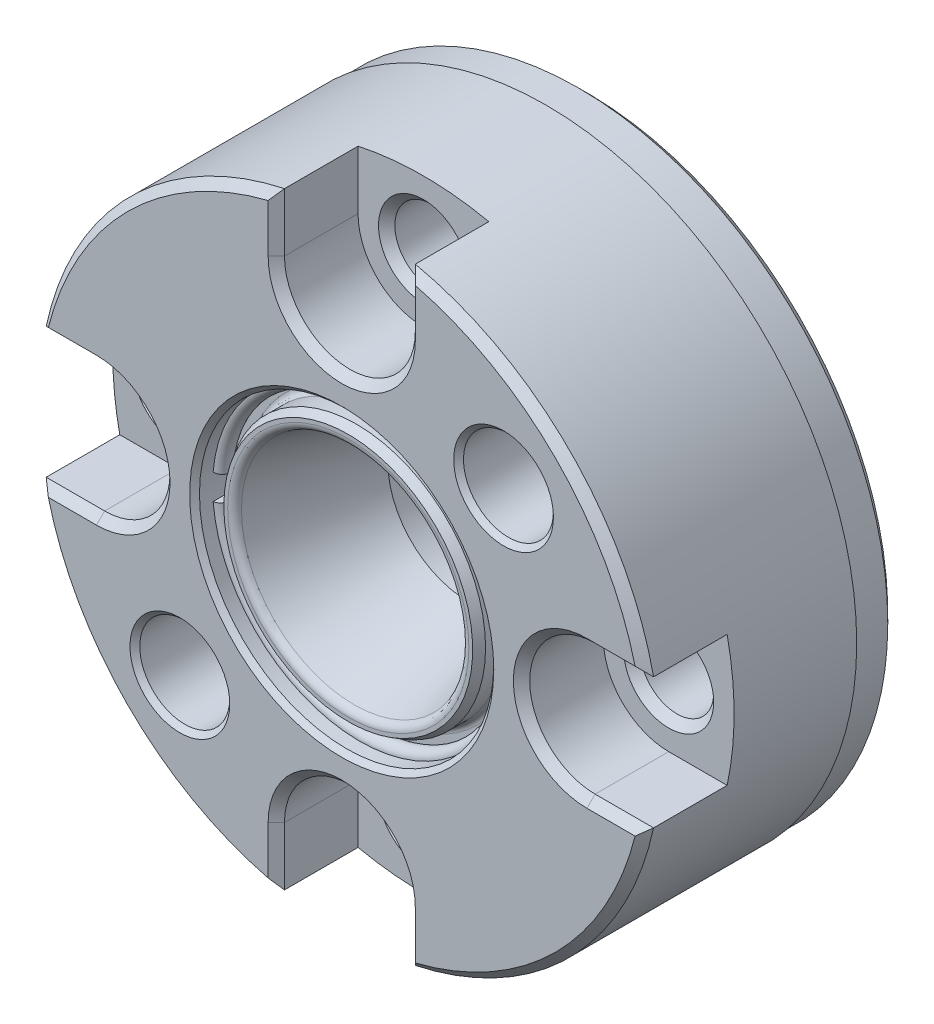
ISO-10303-21;
HEADER;
FILE_DESCRIPTION(('STEP AP214'),'2;1');
FILE_NAME('part.step','',(''),(''),'','','');
FILE_SCHEMA(('AUTOMOTIVE_DESIGN { 1 0 10303 214 1 1 1 1 }'));
ENDSEC;
DATA;
#1=APPLICATION_CONTEXT('core data for automotive mechanical design processes');
#2=APPLICATION_PROTOCOL_DEFINITION('international standard','automotive_design',2000,#1);
#3=PRODUCT_CONTEXT('',#1,'mechanical');
#4=PRODUCT('Part','Part','',(#3));
#5=PRODUCT_RELATED_PRODUCT_CATEGORY('part','',(#4));
#6=PRODUCT_DEFINITION_FORMATION('','',#4);
#7=PRODUCT_DEFINITION_CONTEXT('part definition',#1,'design');
#8=PRODUCT_DEFINITION('design','',#6,#7);
#9=PRODUCT_DEFINITION_SHAPE('','',#8);
#10=(LENGTH_UNIT() NAMED_UNIT(*) SI_UNIT(.MILLI.,.METRE.));
#11=(NAMED_UNIT(*) PLANE_ANGLE_UNIT() SI_UNIT($,.RADIAN.));
#12=(NAMED_UNIT(*) SI_UNIT($,.STERADIAN.) SOLID_ANGLE_UNIT());
#13=UNCERTAINTY_MEASURE_WITH_UNIT(LENGTH_MEASURE(1.E-05),#10,'distance_accuracy_value','');
#14=(GEOMETRIC_REPRESENTATION_CONTEXT(3) GLOBAL_UNCERTAINTY_ASSIGNED_CONTEXT((#13)) GLOBAL_UNIT_ASSIGNED_CONTEXT((#10,
#11,#12)) REPRESENTATION_CONTEXT('',''));
#15=CARTESIAN_POINT('',(0.,0.,0.));
#16=DIRECTION('',(0.,0.,1.));
#17=DIRECTION('',(1.,0.,0.));
#18=AXIS2_PLACEMENT_3D('',#15,#16,#17);
#19=CARTESIAN_POINT('',(-9.,0.,14.6));
#20=DIRECTION('',(0.,0.,1.));
#21=DIRECTION('',(-1.,0.,0.));
#22=AXIS2_PLACEMENT_3D('',#19,#20,#21);
#23=PLANE('',#22);
#24=CARTESIAN_POINT('',(0.,0.,14.6));
#25=DIRECTION('',(0.,0.,1.));
#26=DIRECTION('',(-1.,0.,0.));
#27=AXIS2_PLACEMENT_3D('',#24,#25,#26);
#28=CIRCLE('',#27,7.3767770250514);
#29=CARTESIAN_POINT('',(-7.3767770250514,0.,14.6));
#30=VERTEX_POINT('',#29);
#31=EDGE_CURVE('E1439',#30,#30,#28,.F.);
#32=ORIENTED_EDGE('',*,*,#31,.T.);
#33=EDGE_LOOP('',(#32));
#34=FACE_BOUND('',#33,.T.);
#35=CARTESIAN_POINT('',(0.,0.,14.6));
#36=DIRECTION('',(0.,0.,1.));
#37=DIRECTION('',(-1.,0.,0.));
#38=AXIS2_PLACEMENT_3D('',#35,#36,#37);
#39=CIRCLE('',#38,7.61132486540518);
#40=CARTESIAN_POINT('',(-7.61132486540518,0.,14.6));
#41=VERTEX_POINT('',#40);
#42=EDGE_CURVE('E1442',#41,#41,#39,.T.);
#43=ORIENTED_EDGE('',*,*,#42,.T.);
#44=EDGE_LOOP('',(#43));
#45=FACE_BOUND('',#44,.T.);
#46=ADVANCED_FACE('F14',(#34,#45),#23,.T.);
#47=CARTESIAN_POINT('',(0.,0.,6.9));
#48=DIRECTION('',(0.,0.,1.));
#49=DIRECTION('',(-1.,0.,0.));
#50=AXIS2_PLACEMENT_3D('',#47,#48,#49);
#51=CONICAL_SURFACE('',#50,4.79206052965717,0.279252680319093);
#52=CARTESIAN_POINT('',(0.,0.,7.27642966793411));
#53=DIRECTION('',(0.,0.,1.));
#54=DIRECTION('',(-1.,0.,0.));
#55=AXIS2_PLACEMENT_3D('',#52,#53,#54);
#56=CIRCLE('',#55,4.9);
#57=CARTESIAN_POINT('',(-4.9,0.,7.27642966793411));
#58=VERTEX_POINT('',#57);
#59=EDGE_CURVE('E508',#58,#58,#56,.T.);
#60=ORIENTED_EDGE('',*,*,#59,.F.);
#61=EDGE_LOOP('',(#60));
#62=FACE_BOUND('',#61,.T.);
#63=CARTESIAN_POINT('',(0.,0.,14.2378186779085));
#64=DIRECTION('',(0.,0.,-1.));
#65=DIRECTION('',(1.,0.,0.));
#66=AXIS2_PLACEMENT_3D('',#63,#64,#65);
#67=CIRCLE('',#66,6.89614617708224);
#68=CARTESIAN_POINT('',(6.89614617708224,0.,14.2378186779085));
#69=VERTEX_POINT('',#68);
#70=EDGE_CURVE('E1454',#69,#69,#67,.F.);
#71=ORIENTED_EDGE('',*,*,#70,.T.);
#72=EDGE_LOOP('',(#71));
#73=FACE_BOUND('',#72,.T.);
#74=ADVANCED_FACE('F1357',(#62,#73),#51,.F.);
#75=CARTESIAN_POINT('',(0.,0.,14.6));
#76=DIRECTION('',(0.,0.,-1.));
#77=DIRECTION('',(1.,0.,0.));
#78=AXIS2_PLACEMENT_3D('',#75,#76,#77);
#79=CYLINDRICAL_SURFACE('',#78,7.9);
#80=CARTESIAN_POINT('',(0.,0.,13.));
#81=DIRECTION('',(0.,0.,1.));
#82=DIRECTION('',(-1.,0.,0.));
#83=AXIS2_PLACEMENT_3D('',#80,#81,#82);
#84=CIRCLE('',#83,7.9);
#85=CARTESIAN_POINT('',(-7.9,0.,13.));
#86=VERTEX_POINT('',#85);
#87=EDGE_CURVE('E1447',#86,#86,#84,.T.);
#88=ORIENTED_EDGE('',*,*,#87,.T.);
#89=EDGE_LOOP('',(#88));
#90=FACE_BOUND('',#89,.T.);
#91=CARTESIAN_POINT('',(0.,0.,14.1));
#92=DIRECTION('',(0.,0.,1.));
#93=DIRECTION('',(-1.,0.,0.));
#94=AXIS2_PLACEMENT_3D('',#91,#92,#93);
#95=CIRCLE('',#94,7.9);
#96=CARTESIAN_POINT('',(-7.9,0.,14.1));
#97=VERTEX_POINT('',#96);
#98=EDGE_CURVE('E1444',#97,#97,#95,.F.);
#99=ORIENTED_EDGE('',*,*,#98,.T.);
#100=EDGE_LOOP('',(#99));
#101=FACE_BOUND('',#100,.T.);
#102=ADVANCED_FACE('F1347',(#90,#101),#79,.T.);
#103=CARTESIAN_POINT('',(-7.9,0.,12.6));
#104=DIRECTION('',(0.,0.,1.));
#105=DIRECTION('',(-1.,0.,0.));
#106=AXIS2_PLACEMENT_3D('',#103,#104,#105);
#107=PLANE('',#106);
#108=CARTESIAN_POINT('',(0.,0.,12.6));
#109=DIRECTION('',(0.,0.,1.));
#110=DIRECTION('',(-1.,0.,0.));
#111=AXIS2_PLACEMENT_3D('',#108,#109,#110);
#112=CIRCLE('',#111,9.);
#113=CARTESIAN_POINT('',(-9.,0.,12.6));
#114=VERTEX_POINT('',#113);
#115=EDGE_CURVE('E22',#114,#114,#112,.F.);
#116=ORIENTED_EDGE('',*,*,#115,.F.);
#117=EDGE_LOOP('',(#116));
#118=FACE_BOUND('',#117,.T.);
#119=CARTESIAN_POINT('',(0.,0.,12.6));
#120=DIRECTION('',(0.,0.,1.));
#121=DIRECTION('',(-1.,0.,0.));
#122=AXIS2_PLACEMENT_3D('',#119,#120,#121);
#123=CIRCLE('',#122,8.3);
#124=CARTESIAN_POINT('',(-8.3,0.,12.6));
#125=VERTEX_POINT('',#124);
#126=EDGE_CURVE('E1443',#125,#125,#123,.F.);
#127=ORIENTED_EDGE('',*,*,#126,.T.);
#128=EDGE_LOOP('',(#127));
#129=FACE_BOUND('',#128,.T.);
#130=ADVANCED_FACE('F1337',(#118,#129),#107,.T.);
#131=CARTESIAN_POINT('',(0.,0.,14.1));
#132=DIRECTION('',(0.,0.,-1.));
#133=DIRECTION('',(1.,0.,0.));
#134=AXIS2_PLACEMENT_3D('',#131,#132,#133);
#135=CONICAL_SURFACE('',#134,7.9,0.523598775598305);
#136=ORIENTED_EDGE('',*,*,#42,.F.);
#137=EDGE_LOOP('',(#136));
#138=FACE_BOUND('',#137,.T.);
#139=ORIENTED_EDGE('',*,*,#98,.F.);
#140=EDGE_LOOP('',(#139));
#141=FACE_BOUND('',#140,.T.);
#142=ADVANCED_FACE('F1327',(#138,#141),#135,.T.);
#143=CARTESIAN_POINT('',(0.,0.,13.));
#144=DIRECTION('',(0.,0.,1.));
#145=DIRECTION('',(-1.,0.,0.));
#146=AXIS2_PLACEMENT_3D('',#143,#144,#145);
#147=TOROIDAL_SURFACE('',#146,8.3,0.4);
#148=ORIENTED_EDGE('',*,*,#87,.F.);
#149=EDGE_LOOP('',(#148));
#150=FACE_BOUND('',#149,.T.);
#151=ORIENTED_EDGE('',*,*,#126,.F.);
#152=EDGE_LOOP('',(#151));
#153=FACE_BOUND('',#152,.T.);
#154=ADVANCED_FACE('F1317',(#150,#153),#147,.F.);
#155=CARTESIAN_POINT('',(0.,0.,14.1));
#156=DIRECTION('',(0.,0.,1.));
#157=DIRECTION('',(-1.,0.,0.));
#158=AXIS2_PLACEMENT_3D('',#155,#156,#157);
#159=TOROIDAL_SURFACE('',#158,7.3767770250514,0.5);
#160=ORIENTED_EDGE('',*,*,#31,.F.);
#161=EDGE_LOOP('',(#160));
#162=FACE_BOUND('',#161,.T.);
#163=ORIENTED_EDGE('',*,*,#70,.F.);
#164=EDGE_LOOP('',(#163));
#165=FACE_BOUND('',#164,.T.);
#166=ADVANCED_FACE('F542',(#162,#165),#159,.T.);
#167=CARTESIAN_POINT('',(0.,0.,14.6));
#168=DIRECTION('',(0.,0.,1.));
#169=DIRECTION('',(-1.,0.,0.));
#170=AXIS2_PLACEMENT_3D('',#167,#168,#169);
#171=CYLINDRICAL_SURFACE('',#170,4.9);
#172=ORIENTED_EDGE('',*,*,#59,.T.);
#173=EDGE_LOOP('',(#172));
#174=FACE_BOUND('',#173,.T.);
#175=CARTESIAN_POINT('',(0.,0.,4.69282032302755));
#176=DIRECTION('',(0.,0.,-1.));
#177=DIRECTION('',(1.,0.,0.));
#178=AXIS2_PLACEMENT_3D('',#175,#176,#177);
#179=CIRCLE('',#178,4.9);
#180=CARTESIAN_POINT('',(4.9,0.,4.69282032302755));
#181=VERTEX_POINT('',#180);
#182=EDGE_CURVE('E9',#181,#181,#179,.T.);
#183=ORIENTED_EDGE('',*,*,#182,.T.);
#184=EDGE_LOOP('',(#183));
#185=FACE_BOUND('',#184,.T.);
#186=ADVANCED_FACE('F532',(#174,#185),#171,.F.);
#187=CARTESIAN_POINT('',(15.,-1.02907469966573E-13,0.));
#188=DIRECTION('',(0.,0.,-1.));
#189=DIRECTION('',(-1.,0.,0.));
#190=AXIS2_PLACEMENT_3D('',#187,#188,#189);
#191=CONICAL_SURFACE('',#190,2.75,0.785398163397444);
#192=CARTESIAN_POINT('',(15.,-1.02907469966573E-13,0.500000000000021));
#193=DIRECTION('',(0.,0.,-1.));
#194=DIRECTION('',(-1.,0.,0.));
#195=AXIS2_PLACEMENT_3D('',#192,#193,#194);
#196=CIRCLE('',#195,2.25);
#197=CARTESIAN_POINT('',(12.75,-1.02907469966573E-13,0.500000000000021));
#198=VERTEX_POINT('',#197);
#199=EDGE_CURVE('E583',#198,#198,#196,.T.);
#200=ORIENTED_EDGE('',*,*,#199,.F.);
#201=EDGE_LOOP('',(#200));
#202=FACE_BOUND('',#201,.T.);
#203=CARTESIAN_POINT('',(15.,-1.02907469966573E-13,0.));
#204=DIRECTION('',(0.,0.,-1.));
#205=DIRECTION('',(-1.,0.,0.));
#206=AXIS2_PLACEMENT_3D('',#203,#204,#205);
#207=CIRCLE('',#206,2.75);
#208=CARTESIAN_POINT('',(12.25,-1.02907469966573E-13,0.));
#209=VERTEX_POINT('',#208);
#210=EDGE_CURVE('E584',#209,#209,#207,.F.);
#211=ORIENTED_EDGE('',*,*,#210,.F.);
#212=EDGE_LOOP('',(#211));
#213=FACE_BOUND('',#212,.T.);
#214=ADVANCED_FACE('F529',(#202,#213),#191,.F.);
#215=CARTESIAN_POINT('',(0.,15.,0.));
#216=DIRECTION('',(0.,0.,-1.));
#217=DIRECTION('',(-1.,0.,0.));
#218=AXIS2_PLACEMENT_3D('',#215,#216,#217);
#219=CONICAL_SURFACE('',#218,2.75,0.785398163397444);
#220=CARTESIAN_POINT('',(0.,15.,0.500000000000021));
#221=DIRECTION('',(0.,0.,-1.));
#222=DIRECTION('',(-1.,0.,0.));
#223=AXIS2_PLACEMENT_3D('',#220,#221,#222);
#224=CIRCLE('',#223,2.25);
#225=CARTESIAN_POINT('',(-2.24999999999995,15.,0.500000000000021));
#226=VERTEX_POINT('',#225);
#227=EDGE_CURVE('E708',#226,#226,#224,.T.);
#228=ORIENTED_EDGE('',*,*,#227,.F.);
#229=EDGE_LOOP('',(#228));
#230=FACE_BOUND('',#229,.T.);
#231=CARTESIAN_POINT('',(0.,15.,0.));
#232=DIRECTION('',(0.,0.,-1.));
#233=DIRECTION('',(-1.,0.,0.));
#234=AXIS2_PLACEMENT_3D('',#231,#232,#233);
#235=CIRCLE('',#234,2.75);
#236=CARTESIAN_POINT('',(-2.74999999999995,15.,0.));
#237=VERTEX_POINT('',#236);
#238=EDGE_CURVE('E882',#237,#237,#235,.F.);
#239=ORIENTED_EDGE('',*,*,#238,.F.);
#240=EDGE_LOOP('',(#239));
#241=FACE_BOUND('',#240,.T.);
#242=ADVANCED_FACE('F531',(#230,#241),#219,.F.);
#243=CARTESIAN_POINT('',(-15.,0.,0.));
#244=DIRECTION('',(0.,0.,-1.));
#245=DIRECTION('',(-1.,0.,0.));
#246=AXIS2_PLACEMENT_3D('',#243,#244,#245);
#247=CONICAL_SURFACE('',#246,2.75,0.785398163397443);
#248=CARTESIAN_POINT('',(-15.,0.,0.500000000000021));
#249=DIRECTION('',(0.,0.,-1.));
#250=DIRECTION('',(-1.,0.,0.));
#251=AXIS2_PLACEMENT_3D('',#248,#249,#250);
#252=CIRCLE('',#251,2.25);
#253=CARTESIAN_POINT('',(-17.25,0.,0.500000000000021));
#254=VERTEX_POINT('',#253);
#255=EDGE_CURVE('E312',#254,#254,#252,.T.);
#256=ORIENTED_EDGE('',*,*,#255,.F.);
#257=EDGE_LOOP('',(#256));
#258=FACE_BOUND('',#257,.T.);
#259=CARTESIAN_POINT('',(-15.,0.,0.));
#260=DIRECTION('',(0.,0.,-1.));
#261=DIRECTION('',(-1.,0.,0.));
#262=AXIS2_PLACEMENT_3D('',#259,#260,#261);
#263=CIRCLE('',#262,2.75);
#264=CARTESIAN_POINT('',(-17.75,0.,0.));
#265=VERTEX_POINT('',#264);
#266=EDGE_CURVE('E298',#265,#265,#263,.F.);
#267=ORIENTED_EDGE('',*,*,#266,.F.);
#268=EDGE_LOOP('',(#267));
#269=FACE_BOUND('',#268,.T.);
#270=ADVANCED_FACE('F539',(#258,#269),#247,.F.);
#271=CARTESIAN_POINT('',(-1.5527969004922E-13,-15.,0.));
#272=DIRECTION('',(0.,0.,-1.));
#273=DIRECTION('',(-1.,0.,0.));
#274=AXIS2_PLACEMENT_3D('',#271,#272,#273);
#275=CONICAL_SURFACE('',#274,2.75,0.785398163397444);
#276=CARTESIAN_POINT('',(-1.5527969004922E-13,-15.,0.500000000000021));
#277=DIRECTION('',(0.,0.,-1.));
#278=DIRECTION('',(-1.,0.,0.));
#279=AXIS2_PLACEMENT_3D('',#276,#277,#278);
#280=CIRCLE('',#279,2.25);
#281=CARTESIAN_POINT('',(-2.25000000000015,-15.,0.500000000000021));
#282=VERTEX_POINT('',#281);
#283=EDGE_CURVE('E629',#282,#282,#280,.T.);
#284=ORIENTED_EDGE('',*,*,#283,.F.);
#285=EDGE_LOOP('',(#284));
#286=FACE_BOUND('',#285,.T.);
#287=CARTESIAN_POINT('',(-1.5527969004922E-13,-15.,0.));
#288=DIRECTION('',(0.,0.,-1.));
#289=DIRECTION('',(-1.,0.,0.));
#290=AXIS2_PLACEMENT_3D('',#287,#288,#289);
#291=CIRCLE('',#290,2.75);
#292=CARTESIAN_POINT('',(-2.75000000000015,-15.,0.));
#293=VERTEX_POINT('',#292);
#294=EDGE_CURVE('E617',#293,#293,#291,.F.);
#295=ORIENTED_EDGE('',*,*,#294,.F.);
#296=EDGE_LOOP('',(#295));
#297=FACE_BOUND('',#296,.T.);
#298=ADVANCED_FACE('F445',(#286,#297),#275,.F.);
#299=CARTESIAN_POINT('',(-4.5,0.,0.));
#300=DIRECTION('',(0.,0.,-1.));
#301=DIRECTION('',(-1.,0.,0.));
#302=AXIS2_PLACEMENT_3D('',#299,#300,#301);
#303=PLANE('',#302);
#304=CARTESIAN_POINT('',(9.89949493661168,9.89949493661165,0.));
#305=DIRECTION('',(0.,0.,1.));
#306=DIRECTION('',(1.,0.,0.));
#307=AXIS2_PLACEMENT_3D('',#304,#305,#306);
#308=CIRCLE('',#307,2.9);
#309=CARTESIAN_POINT('',(12.7994949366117,9.89949493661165,0.));
#310=VERTEX_POINT('',#309);
#311=EDGE_CURVE('E1469',#310,#310,#308,.T.);
#312=ORIENTED_EDGE('',*,*,#311,.T.);
#313=EDGE_LOOP('',(#312));
#314=FACE_BOUND('',#313,.T.);
#315=CARTESIAN_POINT('',(-9.89949493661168,-9.89949493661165,0.));
#316=DIRECTION('',(0.,0.,1.));
#317=DIRECTION('',(1.,0.,0.));
#318=AXIS2_PLACEMENT_3D('',#315,#316,#317);
#319=CIRCLE('',#318,2.9);
#320=CARTESIAN_POINT('',(-6.99949493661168,-9.89949493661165,0.));
#321=VERTEX_POINT('',#320);
#322=EDGE_CURVE('E218',#321,#321,#319,.T.);
#323=ORIENTED_EDGE('',*,*,#322,.T.);
#324=EDGE_LOOP('',(#323));
#325=FACE_BOUND('',#324,.T.);
#326=ORIENTED_EDGE('',*,*,#294,.T.);
#327=EDGE_LOOP('',(#326));
#328=FACE_BOUND('',#327,.T.);
#329=ORIENTED_EDGE('',*,*,#210,.T.);
#330=EDGE_LOOP('',(#329));
#331=FACE_BOUND('',#330,.T.);
#332=ORIENTED_EDGE('',*,*,#238,.T.);
#333=EDGE_LOOP('',(#332));
#334=FACE_BOUND('',#333,.T.);
#335=CARTESIAN_POINT('',(0.,0.,0.));
#336=DIRECTION('',(0.,0.,-1.));
#337=DIRECTION('',(-1.,0.,0.));
#338=AXIS2_PLACEMENT_3D('',#335,#336,#337);
#339=CIRCLE('',#338,6.72086463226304);
#340=CARTESIAN_POINT('',(-6.72086463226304,0.,0.));
#341=VERTEX_POINT('',#340);
#342=EDGE_CURVE('E874',#341,#341,#339,.F.);
#343=ORIENTED_EDGE('',*,*,#342,.T.);
#344=EDGE_LOOP('',(#343));
#345=FACE_BOUND('',#344,.T.);
#346=ORIENTED_EDGE('',*,*,#266,.T.);
#347=EDGE_LOOP('',(#346));
#348=FACE_BOUND('',#347,.T.);
#349=CARTESIAN_POINT('',(0.,0.,0.));
#350=DIRECTION('',(0.,0.,-1.));
#351=DIRECTION('',(-1.,0.,0.));
#352=AXIS2_PLACEMENT_3D('',#349,#350,#351);
#353=CIRCLE('',#352,18.4);
#354=CARTESIAN_POINT('',(-18.4,0.,0.));
#355=VERTEX_POINT('',#354);
#356=EDGE_CURVE('E333',#355,#355,#353,.T.);
#357=ORIENTED_EDGE('',*,*,#356,.T.);
#358=EDGE_LOOP('',(#357));
#359=FACE_BOUND('',#358,.T.);
#360=ADVANCED_FACE('F772',(#314,#325,#328,#331,#334,#345,#348,#359),#303,.T.);
#361=CARTESIAN_POINT('',(0.,0.,0.));
#362=DIRECTION('',(0.,0.,1.));
#363=DIRECTION('',(1.,0.,0.));
#364=AXIS2_PLACEMENT_3D('',#361,#362,#363);
#365=CONICAL_SURFACE('',#364,18.4,0.785398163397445);
#366=CARTESIAN_POINT('',(0.,0.,0.5));
#367=DIRECTION('',(0.,0.,-1.));
#368=DIRECTION('',(-1.,0.,0.));
#369=AXIS2_PLACEMENT_3D('',#366,#367,#368);
#370=CIRCLE('',#369,18.9);
#371=CARTESIAN_POINT('',(-18.9,0.,0.500000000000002));
#372=VERTEX_POINT('',#371);
#373=EDGE_CURVE('E339',#372,#372,#370,.F.);
#374=ORIENTED_EDGE('',*,*,#373,.F.);
#375=EDGE_LOOP('',(#374));
#376=FACE_BOUND('',#375,.T.);
#377=ORIENTED_EDGE('',*,*,#356,.F.);
#378=EDGE_LOOP('',(#377));
#379=FACE_BOUND('',#378,.T.);
#380=ADVANCED_FACE('F371',(#376,#379),#365,.T.);
#381=CARTESIAN_POINT('',(15.,-1.02907469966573E-13,0.));
#382=DIRECTION('',(0.,0.,1.));
#383=DIRECTION('',(1.,0.,0.));
#384=AXIS2_PLACEMENT_3D('',#381,#382,#383);
#385=CYLINDRICAL_SURFACE('',#384,2.25);
#386=ORIENTED_EDGE('',*,*,#199,.T.);
#387=EDGE_LOOP('',(#386));
#388=FACE_BOUND('',#387,.T.);
#389=CARTESIAN_POINT('',(15.,-1.02907469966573E-13,9.5));
#390=DIRECTION('',(0.,0.,1.));
#391=DIRECTION('',(1.,0.,0.));
#392=AXIS2_PLACEMENT_3D('',#389,#390,#391);
#393=CIRCLE('',#392,2.25);
#394=CARTESIAN_POINT('',(17.25,-1.02907469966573E-13,9.5));
#395=VERTEX_POINT('',#394);
#396=EDGE_CURVE('E581',#395,#395,#393,.T.);
#397=ORIENTED_EDGE('',*,*,#396,.T.);
#398=EDGE_LOOP('',(#397));
#399=FACE_BOUND('',#398,.T.);
#400=ADVANCED_FACE('F797',(#388,#399),#385,.F.);
#401=CARTESIAN_POINT('',(0.,15.,0.));
#402=DIRECTION('',(0.,0.,1.));
#403=DIRECTION('',(1.,0.,0.));
#404=AXIS2_PLACEMENT_3D('',#401,#402,#403);
#405=CYLINDRICAL_SURFACE('',#404,2.25);
#406=ORIENTED_EDGE('',*,*,#227,.T.);
#407=EDGE_LOOP('',(#406));
#408=FACE_BOUND('',#407,.T.);
#409=CARTESIAN_POINT('',(0.,15.,9.5));
#410=DIRECTION('',(0.,0.,1.));
#411=DIRECTION('',(1.,0.,0.));
#412=AXIS2_PLACEMENT_3D('',#409,#410,#411);
#413=CIRCLE('',#412,2.25);
#414=CARTESIAN_POINT('',(2.25000000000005,15.,9.5));
#415=VERTEX_POINT('',#414);
#416=EDGE_CURVE('E885',#415,#415,#413,.T.);
#417=ORIENTED_EDGE('',*,*,#416,.T.);
#418=EDGE_LOOP('',(#417));
#419=FACE_BOUND('',#418,.T.);
#420=ADVANCED_FACE('F757',(#408,#419),#405,.F.);
#421=CARTESIAN_POINT('',(-15.,0.,0.));
#422=DIRECTION('',(0.,0.,1.));
#423=DIRECTION('',(1.,0.,0.));
#424=AXIS2_PLACEMENT_3D('',#421,#422,#423);
#425=CYLINDRICAL_SURFACE('',#424,2.25);
#426=ORIENTED_EDGE('',*,*,#255,.T.);
#427=EDGE_LOOP('',(#426));
#428=FACE_BOUND('',#427,.T.);
#429=CARTESIAN_POINT('',(-15.,0.,9.5));
#430=DIRECTION('',(0.,0.,1.));
#431=DIRECTION('',(1.,0.,0.));
#432=AXIS2_PLACEMENT_3D('',#429,#430,#431);
#433=CIRCLE('',#432,2.25);
#434=CARTESIAN_POINT('',(-12.75,0.,9.5));
#435=VERTEX_POINT('',#434);
#436=EDGE_CURVE('E309',#435,#435,#433,.T.);
#437=ORIENTED_EDGE('',*,*,#436,.T.);
#438=EDGE_LOOP('',(#437));
#439=FACE_BOUND('',#438,.T.);
#440=ADVANCED_FACE('F753',(#428,#439),#425,.F.);
#441=CARTESIAN_POINT('',(-1.5527969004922E-13,-15.,0.));
#442=DIRECTION('',(0.,0.,1.));
#443=DIRECTION('',(0.,-1.,0.));
#444=AXIS2_PLACEMENT_3D('',#441,#442,#443);
#445=CYLINDRICAL_SURFACE('',#444,2.25);
#446=ORIENTED_EDGE('',*,*,#283,.T.);
#447=EDGE_LOOP('',(#446));
#448=FACE_BOUND('',#447,.T.);
#449=CARTESIAN_POINT('',(-1.5527969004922E-13,-15.,9.5));
#450=DIRECTION('',(0.,0.,1.));
#451=DIRECTION('',(1.,0.,0.));
#452=AXIS2_PLACEMENT_3D('',#449,#450,#451);
#453=CIRCLE('',#452,2.25);
#454=CARTESIAN_POINT('',(2.24999999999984,-15.,9.5));
#455=VERTEX_POINT('',#454);
#456=EDGE_CURVE('E620',#455,#455,#453,.T.);
#457=ORIENTED_EDGE('',*,*,#456,.T.);
#458=EDGE_LOOP('',(#457));
#459=FACE_BOUND('',#458,.T.);
#460=ADVANCED_FACE('F756',(#448,#459),#445,.F.);
#461=CARTESIAN_POINT('',(9.89949493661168,9.89949493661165,0.8));
#462=DIRECTION('',(0.,0.,-1.));
#463=DIRECTION('',(-1.,0.,0.));
#464=AXIS2_PLACEMENT_3D('',#461,#462,#463);
#465=CONICAL_SURFACE('',#464,2.1,0.785398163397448);
#466=CARTESIAN_POINT('',(9.89949493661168,9.89949493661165,0.4));
#467=DIRECTION('',(0.,0.,-1.));
#468=DIRECTION('',(-1.,0.,0.));
#469=AXIS2_PLACEMENT_3D('',#466,#467,#468);
#470=CIRCLE('',#469,2.5);
#471=CARTESIAN_POINT('',(7.39949493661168,9.89949493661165,0.4));
#472=VERTEX_POINT('',#471);
#473=EDGE_CURVE('E496',#472,#472,#470,.F.);
#474=ORIENTED_EDGE('',*,*,#473,.T.);
#475=EDGE_LOOP('',(#474));
#476=FACE_BOUND('',#475,.T.);
#477=ORIENTED_EDGE('',*,*,#311,.F.);
#478=EDGE_LOOP('',(#477));
#479=FACE_BOUND('',#478,.T.);
#480=ADVANCED_FACE('F1238',(#476,#479),#465,.F.);
#481=CARTESIAN_POINT('',(-9.89949493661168,-9.89949493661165,0.8));
#482=DIRECTION('',(0.,0.,-1.));
#483=DIRECTION('',(-1.,0.,0.));
#484=AXIS2_PLACEMENT_3D('',#481,#482,#483);
#485=CONICAL_SURFACE('',#484,2.1,0.785398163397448);
#486=CARTESIAN_POINT('',(-9.89949493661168,-9.89949493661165,0.4));
#487=DIRECTION('',(0.,0.,-1.));
#488=DIRECTION('',(-1.,0.,0.));
#489=AXIS2_PLACEMENT_3D('',#486,#487,#488);
#490=CIRCLE('',#489,2.5);
#491=CARTESIAN_POINT('',(-12.3994949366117,-9.89949493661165,0.4));
#492=VERTEX_POINT('',#491);
#493=EDGE_CURVE('E497',#492,#492,#490,.F.);
#494=ORIENTED_EDGE('',*,*,#493,.T.);
#495=EDGE_LOOP('',(#494));
#496=FACE_BOUND('',#495,.T.);
#497=ORIENTED_EDGE('',*,*,#322,.F.);
#498=EDGE_LOOP('',(#497));
#499=FACE_BOUND('',#498,.T.);
#500=ADVANCED_FACE('F572',(#496,#499),#485,.F.);
#501=CARTESIAN_POINT('',(0.,0.,0.));
#502=DIRECTION('',(0.,0.,-1.));
#503=DIRECTION('',(-1.,0.,0.));
#504=AXIS2_PLACEMENT_3D('',#501,#502,#503);
#505=CYLINDRICAL_SURFACE('',#504,18.9);
#506=ORIENTED_EDGE('',*,*,#373,.T.);
#507=EDGE_LOOP('',(#506));
#508=FACE_BOUND('',#507,.T.);
#509=CARTESIAN_POINT('',(0.,0.,2.5));
#510=DIRECTION('',(0.,0.,-1.));
#511=DIRECTION('',(-1.,0.,0.));
#512=AXIS2_PLACEMENT_3D('',#509,#510,#511);
#513=CIRCLE('',#512,18.9);
#514=CARTESIAN_POINT('',(-18.9,0.,2.5));
#515=VERTEX_POINT('',#514);
#516=EDGE_CURVE('E267',#515,#515,#513,.T.);
#517=ORIENTED_EDGE('',*,*,#516,.T.);
#518=EDGE_LOOP('',(#517));
#519=FACE_BOUND('',#518,.T.);
#520=ADVANCED_FACE('F564',(#508,#519),#505,.T.);
#521=CARTESIAN_POINT('',(15.,-1.02907469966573E-13,9.5));
#522=DIRECTION('',(0.,0.,1.));
#523=DIRECTION('',(1.,0.,0.));
#524=AXIS2_PLACEMENT_3D('',#521,#522,#523);
#525=CONICAL_SURFACE('',#524,2.25,0.785398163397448);
#526=CARTESIAN_POINT('',(15.,-1.02907469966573E-13,10.));
#527=DIRECTION('',(0.,0.,1.));
#528=DIRECTION('',(1.,0.,0.));
#529=AXIS2_PLACEMENT_3D('',#526,#527,#528);
#530=CIRCLE('',#529,2.75);
#531=CARTESIAN_POINT('',(17.75,-1.02907469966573E-13,10.));
#532=VERTEX_POINT('',#531);
#533=EDGE_CURVE('E578',#532,#532,#530,.F.);
#534=ORIENTED_EDGE('',*,*,#533,.F.);
#535=EDGE_LOOP('',(#534));
#536=FACE_BOUND('',#535,.T.);
#537=ORIENTED_EDGE('',*,*,#396,.F.);
#538=EDGE_LOOP('',(#537));
#539=FACE_BOUND('',#538,.T.);
#540=ADVANCED_FACE('F562',(#536,#539),#525,.F.);
#541=CARTESIAN_POINT('',(0.,15.,9.5));
#542=DIRECTION('',(0.,0.,1.));
#543=DIRECTION('',(1.,0.,0.));
#544=AXIS2_PLACEMENT_3D('',#541,#542,#543);
#545=CONICAL_SURFACE('',#544,2.25,0.785398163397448);
#546=CARTESIAN_POINT('',(0.,15.,10.));
#547=DIRECTION('',(0.,0.,1.));
#548=DIRECTION('',(1.,0.,0.));
#549=AXIS2_PLACEMENT_3D('',#546,#547,#548);
#550=CIRCLE('',#549,2.75);
#551=CARTESIAN_POINT('',(2.75000000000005,15.,10.));
#552=VERTEX_POINT('',#551);
#553=EDGE_CURVE('E590',#552,#552,#550,.F.);
#554=ORIENTED_EDGE('',*,*,#553,.F.);
#555=EDGE_LOOP('',(#554));
#556=FACE_BOUND('',#555,.T.);
#557=ORIENTED_EDGE('',*,*,#416,.F.);
#558=EDGE_LOOP('',(#557));
#559=FACE_BOUND('',#558,.T.);
#560=ADVANCED_FACE('F548',(#556,#559),#545,.F.);
#561=CARTESIAN_POINT('',(-15.,0.,9.5));
#562=DIRECTION('',(0.,0.,1.));
#563=DIRECTION('',(1.,0.,0.));
#564=AXIS2_PLACEMENT_3D('',#561,#562,#563);
#565=CONICAL_SURFACE('',#564,2.25,0.785398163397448);
#566=CARTESIAN_POINT('',(-15.,0.,10.));
#567=DIRECTION('',(0.,0.,1.));
#568=DIRECTION('',(1.,0.,0.));
#569=AXIS2_PLACEMENT_3D('',#566,#567,#568);
#570=CIRCLE('',#569,2.75);
#571=CARTESIAN_POINT('',(-12.25,0.,10.));
#572=VERTEX_POINT('',#571);
#573=EDGE_CURVE('E330',#572,#572,#570,.F.);
#574=ORIENTED_EDGE('',*,*,#573,.F.);
#575=EDGE_LOOP('',(#574));
#576=FACE_BOUND('',#575,.T.);
#577=ORIENTED_EDGE('',*,*,#436,.F.);
#578=EDGE_LOOP('',(#577));
#579=FACE_BOUND('',#578,.T.);
#580=ADVANCED_FACE('F570',(#576,#579),#565,.F.);
#581=CARTESIAN_POINT('',(-1.5527969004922E-13,-15.,9.5));
#582=DIRECTION('',(0.,0.,1.));
#583=DIRECTION('',(1.,0.,0.));
#584=AXIS2_PLACEMENT_3D('',#581,#582,#583);
#585=CONICAL_SURFACE('',#584,2.25,0.785398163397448);
#586=CARTESIAN_POINT('',(-1.5527969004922E-13,-15.,10.));
#587=DIRECTION('',(0.,0.,1.));
#588=DIRECTION('',(0.,-1.,0.));
#589=AXIS2_PLACEMENT_3D('',#586,#587,#588);
#590=CIRCLE('',#589,2.75);
#591=CARTESIAN_POINT('',(-1.5527969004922E-13,-17.75,10.));
#592=VERTEX_POINT('',#591);
#593=EDGE_CURVE('E464',#592,#592,#590,.F.);
#594=ORIENTED_EDGE('',*,*,#593,.F.);
#595=EDGE_LOOP('',(#594));
#596=FACE_BOUND('',#595,.T.);
#597=ORIENTED_EDGE('',*,*,#456,.F.);
#598=EDGE_LOOP('',(#597));
#599=FACE_BOUND('',#598,.T.);
#600=ADVANCED_FACE('F456',(#596,#599),#585,.F.);
#601=CARTESIAN_POINT('',(9.89949493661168,9.89949493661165,15.));
#602=DIRECTION('',(0.,0.,-1.));
#603=DIRECTION('',(-1.,0.,0.));
#604=AXIS2_PLACEMENT_3D('',#601,#602,#603);
#605=CYLINDRICAL_SURFACE('',#604,2.5);
#606=CARTESIAN_POINT('',(9.89949493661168,9.89949493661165,9.85566243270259));
#607=DIRECTION('',(0.,0.,1.));
#608=DIRECTION('',(1.,0.,0.));
#609=AXIS2_PLACEMENT_3D('',#606,#607,#608);
#610=CIRCLE('',#609,2.5);
#611=CARTESIAN_POINT('',(12.3994949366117,9.89949493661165,9.85566243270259));
#612=VERTEX_POINT('',#611);
#613=EDGE_CURVE('E493',#612,#612,#610,.F.);
#614=ORIENTED_EDGE('',*,*,#613,.F.);
#615=EDGE_LOOP('',(#614));
#616=FACE_BOUND('',#615,.T.);
#617=ORIENTED_EDGE('',*,*,#473,.F.);
#618=EDGE_LOOP('',(#617));
#619=FACE_BOUND('',#618,.T.);
#620=ADVANCED_FACE('F1187',(#616,#619),#605,.F.);
#621=CARTESIAN_POINT('',(-9.89949493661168,-9.89949493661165,15.));
#622=DIRECTION('',(0.,0.,-1.));
#623=DIRECTION('',(-1.,0.,0.));
#624=AXIS2_PLACEMENT_3D('',#621,#622,#623);
#625=CYLINDRICAL_SURFACE('',#624,2.5);
#626=CARTESIAN_POINT('',(-9.89949493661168,-9.89949493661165,9.85566243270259));
#627=DIRECTION('',(0.,0.,1.));
#628=DIRECTION('',(1.,0.,0.));
#629=AXIS2_PLACEMENT_3D('',#626,#627,#628);
#630=CIRCLE('',#629,2.5);
#631=CARTESIAN_POINT('',(-7.39949493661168,-9.89949493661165,9.85566243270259));
#632=VERTEX_POINT('',#631);
#633=EDGE_CURVE('E498',#632,#632,#630,.F.);
#634=ORIENTED_EDGE('',*,*,#633,.F.);
#635=EDGE_LOOP('',(#634));
#636=FACE_BOUND('',#635,.T.);
#637=ORIENTED_EDGE('',*,*,#493,.F.);
#638=EDGE_LOOP('',(#637));
#639=FACE_BOUND('',#638,.T.);
#640=ADVANCED_FACE('F751',(#636,#639),#625,.F.);
#641=CARTESIAN_POINT('',(-19.,0.,2.5));
#642=DIRECTION('',(0.,0.,1.));
#643=DIRECTION('',(1.,0.,0.));
#644=AXIS2_PLACEMENT_3D('',#641,#642,#643);
#645=PLANE('',#644);
#646=ORIENTED_EDGE('',*,*,#516,.F.);
#647=EDGE_LOOP('',(#646));
#648=FACE_BOUND('',#647,.T.);
#649=CARTESIAN_POINT('',(0.,0.,2.5));
#650=DIRECTION('',(0.,0.,-1.));
#651=DIRECTION('',(-1.,0.,0.));
#652=AXIS2_PLACEMENT_3D('',#649,#650,#651);
#653=CIRCLE('',#652,19.);
#654=CARTESIAN_POINT('',(-19.,0.,2.5));
#655=VERTEX_POINT('',#654);
#656=EDGE_CURVE('E278',#655,#655,#653,.T.);
#657=ORIENTED_EDGE('',*,*,#656,.T.);
#658=EDGE_LOOP('',(#657));
#659=FACE_BOUND('',#658,.T.);
#660=ADVANCED_FACE('F747',(#648,#659),#645,.F.);
#661=CARTESIAN_POINT('',(15.,-1.02907469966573E-13,10.));
#662=DIRECTION('',(0.,0.,1.));
#663=DIRECTION('',(-1.,0.,0.));
#664=AXIS2_PLACEMENT_3D('',#661,#662,#663);
#665=PLANE('',#664);
#666=ORIENTED_EDGE('',*,*,#533,.T.);
#667=EDGE_LOOP('',(#666));
#668=FACE_BOUND('',#667,.T.);
#669=CARTESIAN_POINT('',(15.,-1.02907469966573E-13,10.));
#670=DIRECTION('',(0.,0.,1.));
#671=DIRECTION('',(-1.,0.,0.));
#672=AXIS2_PLACEMENT_3D('',#669,#670,#671);
#673=CIRCLE('',#672,4.);
#674=CARTESIAN_POINT('',(15.,3.9999999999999,10.));
#675=VERTEX_POINT('',#674);
#676=CARTESIAN_POINT('',(15.,-4.0000000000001,10.));
#677=VERTEX_POINT('',#676);
#678=EDGE_CURVE('E225',#675,#677,#673,.T.);
#679=ORIENTED_EDGE('',*,*,#678,.T.);
#680=DIRECTION('',(1.,0.,0.));
#681=VECTOR('',#680,1.);
#682=CARTESIAN_POINT('',(15.,-4.0000000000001,10.));
#683=LINE('',#682,#681);
#684=CARTESIAN_POINT('',(18.5741756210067,-4.00000000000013,10.));
#685=VERTEX_POINT('',#684);
#686=EDGE_CURVE('E232',#677,#685,#683,.T.);
#687=ORIENTED_EDGE('',*,*,#686,.T.);
#688=CARTESIAN_POINT('',(0.,0.,10.));
#689=DIRECTION('',(0.,0.,1.));
#690=DIRECTION('',(-1.,0.,0.));
#691=AXIS2_PLACEMENT_3D('',#688,#689,#690);
#692=CIRCLE('',#691,19.);
#693=CARTESIAN_POINT('',(18.5741756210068,3.99999999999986,10.));
#694=VERTEX_POINT('',#693);
#695=EDGE_CURVE('E235',#685,#694,#692,.T.);
#696=ORIENTED_EDGE('',*,*,#695,.T.);
#697=DIRECTION('',(-1.,0.,0.));
#698=VECTOR('',#697,1.);
#699=CARTESIAN_POINT('',(15.,3.9999999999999,10.));
#700=LINE('',#699,#698);
#701=EDGE_CURVE('E237',#694,#675,#700,.T.);
#702=ORIENTED_EDGE('',*,*,#701,.T.);
#703=EDGE_LOOP('',(#679,#687,#696,#702));
#704=FACE_BOUND('',#703,.T.);
#705=ADVANCED_FACE('F750',(#668,#704),#665,.T.);
#706=CARTESIAN_POINT('',(0.,15.,10.));
#707=DIRECTION('',(0.,0.,1.));
#708=DIRECTION('',(0.,-1.,0.));
#709=AXIS2_PLACEMENT_3D('',#706,#707,#708);
#710=PLANE('',#709);
#711=ORIENTED_EDGE('',*,*,#553,.T.);
#712=EDGE_LOOP('',(#711));
#713=FACE_BOUND('',#712,.T.);
#714=CARTESIAN_POINT('',(0.,15.,10.));
#715=DIRECTION('',(0.,0.,1.));
#716=DIRECTION('',(0.,-1.,0.));
#717=AXIS2_PLACEMENT_3D('',#714,#715,#716);
#718=CIRCLE('',#717,4.);
#719=CARTESIAN_POINT('',(-3.99999999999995,15.,10.));
#720=VERTEX_POINT('',#719);
#721=CARTESIAN_POINT('',(4.00000000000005,15.,10.));
#722=VERTEX_POINT('',#721);
#723=EDGE_CURVE('E244',#720,#722,#718,.T.);
#724=ORIENTED_EDGE('',*,*,#723,.T.);
#725=DIRECTION('',(0.,1.,0.));
#726=VECTOR('',#725,1.);
#727=CARTESIAN_POINT('',(4.00000000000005,15.,10.));
#728=LINE('',#727,#726);
#729=CARTESIAN_POINT('',(4.00000000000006,18.5741756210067,10.));
#730=VERTEX_POINT('',#729);
#731=EDGE_CURVE('E255',#722,#730,#728,.T.);
#732=ORIENTED_EDGE('',*,*,#731,.T.);
#733=CARTESIAN_POINT('',(0.,0.,10.));
#734=DIRECTION('',(0.,0.,1.));
#735=DIRECTION('',(0.,-1.,0.));
#736=AXIS2_PLACEMENT_3D('',#733,#734,#735);
#737=CIRCLE('',#736,19.);
#738=CARTESIAN_POINT('',(-3.99999999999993,18.5741756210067,10.));
#739=VERTEX_POINT('',#738);
#740=EDGE_CURVE('E258',#730,#739,#737,.T.);
#741=ORIENTED_EDGE('',*,*,#740,.T.);
#742=DIRECTION('',(0.,-1.,0.));
#743=VECTOR('',#742,1.);
#744=CARTESIAN_POINT('',(-3.99999999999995,15.,10.));
#745=LINE('',#744,#743);
#746=EDGE_CURVE('E260',#739,#720,#745,.T.);
#747=ORIENTED_EDGE('',*,*,#746,.T.);
#748=EDGE_LOOP('',(#724,#732,#741,#747));
#749=FACE_BOUND('',#748,.T.);
#750=ADVANCED_FACE('F725',(#713,#749),#710,.T.);
#751=CARTESIAN_POINT('',(-15.,0.,10.));
#752=DIRECTION('',(0.,0.,1.));
#753=DIRECTION('',(1.,0.,0.));
#754=AXIS2_PLACEMENT_3D('',#751,#752,#753);
#755=PLANE('',#754);
#756=ORIENTED_EDGE('',*,*,#573,.T.);
#757=EDGE_LOOP('',(#756));
#758=FACE_BOUND('',#757,.T.);
#759=CARTESIAN_POINT('',(-15.,0.,10.));
#760=DIRECTION('',(0.,0.,1.));
#761=DIRECTION('',(1.,0.,0.));
#762=AXIS2_PLACEMENT_3D('',#759,#760,#761);
#763=CIRCLE('',#762,4.);
#764=CARTESIAN_POINT('',(-15.,-4.,10.));
#765=VERTEX_POINT('',#764);
#766=CARTESIAN_POINT('',(-15.,4.,10.));
#767=VERTEX_POINT('',#766);
#768=EDGE_CURVE('E282',#765,#767,#763,.T.);
#769=ORIENTED_EDGE('',*,*,#768,.T.);
#770=DIRECTION('',(-1.,0.,0.));
#771=VECTOR('',#770,1.);
#772=CARTESIAN_POINT('',(-15.,4.,10.));
#773=LINE('',#772,#771);
#774=CARTESIAN_POINT('',(-18.5741756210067,4.,10.));
#775=VERTEX_POINT('',#774);
#776=EDGE_CURVE('E285',#767,#775,#773,.T.);
#777=ORIENTED_EDGE('',*,*,#776,.T.);
#778=CARTESIAN_POINT('',(0.,0.,10.));
#779=DIRECTION('',(0.,0.,1.));
#780=DIRECTION('',(1.,0.,0.));
#781=AXIS2_PLACEMENT_3D('',#778,#779,#780);
#782=CIRCLE('',#781,19.);
#783=CARTESIAN_POINT('',(-18.5741756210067,-4.,10.));
#784=VERTEX_POINT('',#783);
#785=EDGE_CURVE('E289',#775,#784,#782,.T.);
#786=ORIENTED_EDGE('',*,*,#785,.T.);
#787=DIRECTION('',(1.,0.,0.));
#788=VECTOR('',#787,1.);
#789=CARTESIAN_POINT('',(-15.,-4.,10.));
#790=LINE('',#789,#788);
#791=EDGE_CURVE('E291',#784,#765,#790,.T.);
#792=ORIENTED_EDGE('',*,*,#791,.T.);
#793=EDGE_LOOP('',(#769,#777,#786,#792));
#794=FACE_BOUND('',#793,.T.);
#795=ADVANCED_FACE('F759',(#758,#794),#755,.T.);
#796=CARTESIAN_POINT('',(-1.5527969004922E-13,-15.,10.));
#797=DIRECTION('',(0.,0.,1.));
#798=DIRECTION('',(0.,1.,0.));
#799=AXIS2_PLACEMENT_3D('',#796,#797,#798);
#800=PLANE('',#799);
#801=ORIENTED_EDGE('',*,*,#593,.T.);
#802=EDGE_LOOP('',(#801));
#803=FACE_BOUND('',#802,.T.);
#804=CARTESIAN_POINT('',(-1.5527969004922E-13,-15.,10.));
#805=DIRECTION('',(0.,0.,1.));
#806=DIRECTION('',(0.,1.,0.));
#807=AXIS2_PLACEMENT_3D('',#804,#805,#806);
#808=CIRCLE('',#807,4.);
#809=CARTESIAN_POINT('',(3.99999999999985,-15.,10.));
#810=VERTEX_POINT('',#809);
#811=CARTESIAN_POINT('',(-4.00000000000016,-15.,10.));
#812=VERTEX_POINT('',#811);
#813=EDGE_CURVE('E193',#810,#812,#808,.T.);
#814=ORIENTED_EDGE('',*,*,#813,.T.);
#815=DIRECTION('',(0.,-1.,0.));
#816=VECTOR('',#815,1.);
#817=CARTESIAN_POINT('',(-4.00000000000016,-15.,10.));
#818=LINE('',#817,#816);
#819=CARTESIAN_POINT('',(-4.0000000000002,-18.5741756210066,10.));
#820=VERTEX_POINT('',#819);
#821=EDGE_CURVE('E203',#812,#820,#818,.T.);
#822=ORIENTED_EDGE('',*,*,#821,.T.);
#823=CARTESIAN_POINT('',(0.,0.,10.));
#824=DIRECTION('',(0.,0.,1.));
#825=DIRECTION('',(0.,1.,0.));
#826=AXIS2_PLACEMENT_3D('',#823,#824,#825);
#827=CIRCLE('',#826,19.);
#828=CARTESIAN_POINT('',(3.9999999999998,-18.5741756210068,10.));
#829=VERTEX_POINT('',#828);
#830=EDGE_CURVE('E208',#820,#829,#827,.T.);
#831=ORIENTED_EDGE('',*,*,#830,.T.);
#832=DIRECTION('',(0.,1.,0.));
#833=VECTOR('',#832,1.);
#834=CARTESIAN_POINT('',(3.99999999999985,-15.,10.));
#835=LINE('',#834,#833);
#836=EDGE_CURVE('E200',#829,#810,#835,.T.);
#837=ORIENTED_EDGE('',*,*,#836,.T.);
#838=EDGE_LOOP('',(#814,#822,#831,#837));
#839=FACE_BOUND('',#838,.T.);
#840=ADVANCED_FACE('F210',(#803,#839),#800,.T.);
#841=CARTESIAN_POINT('',(9.89949493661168,9.89949493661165,10.));
#842=DIRECTION('',(0.,0.,1.));
#843=DIRECTION('',(1.,0.,0.));
#844=AXIS2_PLACEMENT_3D('',#841,#842,#843);
#845=CONICAL_SURFACE('',#844,2.75,1.0471975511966);
#846=ORIENTED_EDGE('',*,*,#613,.T.);
#847=EDGE_LOOP('',(#846));
#848=FACE_BOUND('',#847,.T.);
#849=CARTESIAN_POINT('',(9.89949493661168,9.89949493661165,10.));
#850=DIRECTION('',(0.,0.,1.));
#851=DIRECTION('',(1.,0.,0.));
#852=AXIS2_PLACEMENT_3D('',#849,#850,#851);
#853=CIRCLE('',#852,2.75);
#854=CARTESIAN_POINT('',(12.6494949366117,9.89949493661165,10.));
#855=VERTEX_POINT('',#854);
#856=EDGE_CURVE('E1466',#855,#855,#853,.T.);
#857=ORIENTED_EDGE('',*,*,#856,.T.);
#858=EDGE_LOOP('',(#857));
#859=FACE_BOUND('',#858,.T.);
#860=ADVANCED_FACE('F819',(#848,#859),#845,.F.);
#861=CARTESIAN_POINT('',(-9.89949493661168,-9.89949493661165,10.));
#862=DIRECTION('',(0.,0.,1.));
#863=DIRECTION('',(1.,0.,0.));
#864=AXIS2_PLACEMENT_3D('',#861,#862,#863);
#865=CONICAL_SURFACE('',#864,2.75,1.0471975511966);
#866=ORIENTED_EDGE('',*,*,#633,.T.);
#867=EDGE_LOOP('',(#866));
#868=FACE_BOUND('',#867,.T.);
#869=CARTESIAN_POINT('',(-9.89949493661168,-9.89949493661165,10.));
#870=DIRECTION('',(0.,0.,1.));
#871=DIRECTION('',(1.,0.,0.));
#872=AXIS2_PLACEMENT_3D('',#869,#870,#871);
#873=CIRCLE('',#872,2.75);
#874=CARTESIAN_POINT('',(-7.14949493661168,-9.89949493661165,10.));
#875=VERTEX_POINT('',#874);
#876=EDGE_CURVE('E1471',#875,#875,#873,.T.);
#877=ORIENTED_EDGE('',*,*,#876,.T.);
#878=EDGE_LOOP('',(#877));
#879=FACE_BOUND('',#878,.T.);
#880=ADVANCED_FACE('F825',(#868,#879),#865,.F.);
#881=CARTESIAN_POINT('',(-4.00000000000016,-15.,10.));
#882=DIRECTION('',(-1.,0.,0.));
#883=DIRECTION('',(0.,-1.,0.));
#884=AXIS2_PLACEMENT_3D('',#881,#882,#883);
#885=PLANE('',#884);
#886=DIRECTION('',(0.,0.,1.));
#887=VECTOR('',#886,1.);
#888=CARTESIAN_POINT('',(-4.00000000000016,-15.,10.));
#889=LINE('',#888,#887);
#890=CARTESIAN_POINT('',(-4.00000000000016,-15.,14.5));
#891=VERTEX_POINT('',#890);
#892=EDGE_CURVE('E188',#812,#891,#889,.T.);
#893=ORIENTED_EDGE('',*,*,#892,.T.);
#894=DIRECTION('',(0.,-1.,0.));
#895=VECTOR('',#894,1.);
#896=CARTESIAN_POINT('',(-4.00000000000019,-18.0623918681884,14.5));
#897=LINE('',#896,#895);
#898=CARTESIAN_POINT('',(-4.0000000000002,-18.5741756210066,14.5));
#899=VERTEX_POINT('',#898);
#900=EDGE_CURVE('E465',#891,#899,#897,.T.);
#901=ORIENTED_EDGE('',*,*,#900,.T.);
#902=DIRECTION('',(0.,0.,1.));
#903=VECTOR('',#902,1.);
#904=CARTESIAN_POINT('',(-4.0000000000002,-18.5741756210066,10.));
#905=LINE('',#904,#903);
#906=EDGE_CURVE('E199',#820,#899,#905,.T.);
#907=ORIENTED_EDGE('',*,*,#906,.F.);
#908=ORIENTED_EDGE('',*,*,#821,.F.);
#909=EDGE_LOOP('',(#893,#901,#907,#908));
#910=FACE_BOUND('',#909,.T.);
#911=ADVANCED_FACE('F204',(#910),#885,.F.);
#912=CARTESIAN_POINT('',(-15.,-4.,10.));
#913=DIRECTION('',(0.,-1.,0.));
#914=DIRECTION('',(0.,0.,-1.));
#915=AXIS2_PLACEMENT_3D('',#912,#913,#914);
#916=PLANE('',#915);
#917=DIRECTION('',(0.,0.,1.));
#918=VECTOR('',#917,1.);
#919=CARTESIAN_POINT('',(-18.5741756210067,-4.,10.));
#920=LINE('',#919,#918);
#921=CARTESIAN_POINT('',(-18.5741756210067,-4.,14.5));
#922=VERTEX_POINT('',#921);
#923=EDGE_CURVE('E299',#784,#922,#920,.T.);
#924=ORIENTED_EDGE('',*,*,#923,.T.);
#925=DIRECTION('',(1.,0.,0.));
#926=VECTOR('',#925,1.);
#927=CARTESIAN_POINT('',(-15.,-4.,14.5));
#928=LINE('',#927,#926);
#929=CARTESIAN_POINT('',(-15.,-4.,14.5));
#930=VERTEX_POINT('',#929);
#931=EDGE_CURVE('E315',#922,#930,#928,.T.);
#932=ORIENTED_EDGE('',*,*,#931,.T.);
#933=DIRECTION('',(0.,0.,1.));
#934=VECTOR('',#933,1.);
#935=CARTESIAN_POINT('',(-15.,-4.,10.));
#936=LINE('',#935,#934);
#937=EDGE_CURVE('E295',#765,#930,#936,.T.);
#938=ORIENTED_EDGE('',*,*,#937,.F.);
#939=ORIENTED_EDGE('',*,*,#791,.F.);
#940=EDGE_LOOP('',(#924,#932,#938,#939));
#941=FACE_BOUND('',#940,.T.);
#942=ADVANCED_FACE('F667',(#941),#916,.F.);
#943=CARTESIAN_POINT('',(-15.,0.,10.));
#944=DIRECTION('',(0.,0.,1.));
#945=DIRECTION('',(1.,0.,0.));
#946=AXIS2_PLACEMENT_3D('',#943,#944,#945);
#947=CYLINDRICAL_SURFACE('',#946,4.);
#948=ORIENTED_EDGE('',*,*,#937,.T.);
#949=CARTESIAN_POINT('',(-15.,0.,14.5));
#950=DIRECTION('',(0.,0.,1.));
#951=DIRECTION('',(1.,0.,0.));
#952=AXIS2_PLACEMENT_3D('',#949,#950,#951);
#953=CIRCLE('',#952,4.);
#954=CARTESIAN_POINT('',(-15.,4.,14.5));
#955=VERTEX_POINT('',#954);
#956=EDGE_CURVE('E325',#930,#955,#953,.T.);
#957=ORIENTED_EDGE('',*,*,#956,.T.);
#958=DIRECTION('',(0.,0.,1.));
#959=VECTOR('',#958,1.);
#960=CARTESIAN_POINT('',(-15.,4.,10.));
#961=LINE('',#960,#959);
#962=EDGE_CURVE('E294',#767,#955,#961,.T.);
#963=ORIENTED_EDGE('',*,*,#962,.F.);
#964=ORIENTED_EDGE('',*,*,#768,.F.);
#965=EDGE_LOOP('',(#948,#957,#963,#964));
#966=FACE_BOUND('',#965,.T.);
#967=ADVANCED_FACE('F675',(#966),#947,.F.);
#968=CARTESIAN_POINT('',(-15.,4.,10.));
#969=DIRECTION('',(0.,1.,0.));
#970=DIRECTION('',(0.,0.,1.));
#971=AXIS2_PLACEMENT_3D('',#968,#969,#970);
#972=PLANE('',#971);
#973=ORIENTED_EDGE('',*,*,#962,.T.);
#974=DIRECTION('',(-1.,0.,0.));
#975=VECTOR('',#974,1.);
#976=CARTESIAN_POINT('',(-18.5741756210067,4.,14.5));
#977=LINE('',#976,#975);
#978=CARTESIAN_POINT('',(-18.5741756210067,4.,14.5));
#979=VERTEX_POINT('',#978);
#980=EDGE_CURVE('E327',#955,#979,#977,.T.);
#981=ORIENTED_EDGE('',*,*,#980,.T.);
#982=DIRECTION('',(0.,0.,1.));
#983=VECTOR('',#982,1.);
#984=CARTESIAN_POINT('',(-18.5741756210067,4.,10.));
#985=LINE('',#984,#983);
#986=EDGE_CURVE('E302',#775,#979,#985,.T.);
#987=ORIENTED_EDGE('',*,*,#986,.F.);
#988=ORIENTED_EDGE('',*,*,#776,.F.);
#989=EDGE_LOOP('',(#973,#981,#987,#988));
#990=FACE_BOUND('',#989,.T.);
#991=ADVANCED_FACE('F680',(#990),#972,.F.);
#992=CARTESIAN_POINT('',(-3.99999999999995,15.,10.));
#993=DIRECTION('',(-1.,0.,0.));
#994=DIRECTION('',(0.,-1.,0.));
#995=AXIS2_PLACEMENT_3D('',#992,#993,#994);
#996=PLANE('',#995);
#997=DIRECTION('',(0.,0.,1.));
#998=VECTOR('',#997,1.);
#999=CARTESIAN_POINT('',(-3.99999999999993,18.5741756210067,10.));
#1000=LINE('',#999,#998);
#1001=CARTESIAN_POINT('',(-3.99999999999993,18.5741756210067,14.5));
#1002=VERTEX_POINT('',#1001);
#1003=EDGE_CURVE('E268',#739,#1002,#1000,.T.);
#1004=ORIENTED_EDGE('',*,*,#1003,.T.);
#1005=DIRECTION('',(0.,-1.,0.));
#1006=VECTOR('',#1005,1.);
#1007=CARTESIAN_POINT('',(-3.99999999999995,15.,14.5));
#1008=LINE('',#1007,#1006);
#1009=CARTESIAN_POINT('',(-3.99999999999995,15.,14.5));
#1010=VERTEX_POINT('',#1009);
#1011=EDGE_CURVE('E703',#1002,#1010,#1008,.T.);
#1012=ORIENTED_EDGE('',*,*,#1011,.T.);
#1013=DIRECTION('',(0.,0.,1.));
#1014=VECTOR('',#1013,1.);
#1015=CARTESIAN_POINT('',(-3.99999999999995,15.,10.));
#1016=LINE('',#1015,#1014);
#1017=EDGE_CURVE('E264',#720,#1010,#1016,.T.);
#1018=ORIENTED_EDGE('',*,*,#1017,.F.);
#1019=ORIENTED_EDGE('',*,*,#746,.F.);
#1020=EDGE_LOOP('',(#1004,#1012,#1018,#1019));
#1021=FACE_BOUND('',#1020,.T.);
#1022=ADVANCED_FACE('F727',(#1021),#996,.F.);
#1023=CARTESIAN_POINT('',(0.,15.,10.));
#1024=DIRECTION('',(0.,0.,1.));
#1025=DIRECTION('',(1.,0.,0.));
#1026=AXIS2_PLACEMENT_3D('',#1023,#1024,#1025);
#1027=CYLINDRICAL_SURFACE('',#1026,4.);
#1028=ORIENTED_EDGE('',*,*,#1017,.T.);
#1029=CARTESIAN_POINT('',(0.,15.,14.5));
#1030=DIRECTION('',(0.,0.,1.));
#1031=DIRECTION('',(1.,0.,0.));
#1032=AXIS2_PLACEMENT_3D('',#1029,#1030,#1031);
#1033=CIRCLE('',#1032,4.);
#1034=CARTESIAN_POINT('',(4.00000000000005,15.,14.5));
#1035=VERTEX_POINT('',#1034);
#1036=EDGE_CURVE('E712',#1010,#1035,#1033,.T.);
#1037=ORIENTED_EDGE('',*,*,#1036,.T.);
#1038=DIRECTION('',(0.,0.,1.));
#1039=VECTOR('',#1038,1.);
#1040=CARTESIAN_POINT('',(4.00000000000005,15.,10.));
#1041=LINE('',#1040,#1039);
#1042=EDGE_CURVE('E263',#722,#1035,#1041,.T.);
#1043=ORIENTED_EDGE('',*,*,#1042,.F.);
#1044=ORIENTED_EDGE('',*,*,#723,.F.);
#1045=EDGE_LOOP('',(#1028,#1037,#1043,#1044));
#1046=FACE_BOUND('',#1045,.T.);
#1047=ADVANCED_FACE('F730',(#1046),#1027,.F.);
#1048=CARTESIAN_POINT('',(4.00000000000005,15.,10.));
#1049=DIRECTION('',(1.,0.,0.));
#1050=DIRECTION('',(0.,1.,0.));
#1051=AXIS2_PLACEMENT_3D('',#1048,#1049,#1050);
#1052=PLANE('',#1051);
#1053=ORIENTED_EDGE('',*,*,#1042,.T.);
#1054=DIRECTION('',(0.,1.,0.));
#1055=VECTOR('',#1054,1.);
#1056=CARTESIAN_POINT('',(4.00000000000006,18.0623918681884,14.5));
#1057=LINE('',#1056,#1055);
#1058=CARTESIAN_POINT('',(4.00000000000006,18.5741756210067,14.5));
#1059=VERTEX_POINT('',#1058);
#1060=EDGE_CURVE('E699',#1035,#1059,#1057,.T.);
#1061=ORIENTED_EDGE('',*,*,#1060,.T.);
#1062=DIRECTION('',(0.,0.,1.));
#1063=VECTOR('',#1062,1.);
#1064=CARTESIAN_POINT('',(4.00000000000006,18.5741756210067,10.));
#1065=LINE('',#1064,#1063);
#1066=EDGE_CURVE('E271',#730,#1059,#1065,.T.);
#1067=ORIENTED_EDGE('',*,*,#1066,.F.);
#1068=ORIENTED_EDGE('',*,*,#731,.F.);
#1069=EDGE_LOOP('',(#1053,#1061,#1067,#1068));
#1070=FACE_BOUND('',#1069,.T.);
#1071=ADVANCED_FACE('F717',(#1070),#1052,.F.);
#1072=CARTESIAN_POINT('',(15.,3.9999999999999,10.));
#1073=DIRECTION('',(0.,1.,0.));
#1074=DIRECTION('',(-1.,0.,0.));
#1075=AXIS2_PLACEMENT_3D('',#1072,#1073,#1074);
#1076=PLANE('',#1075);
#1077=DIRECTION('',(0.,0.,1.));
#1078=VECTOR('',#1077,1.);
#1079=CARTESIAN_POINT('',(18.5741756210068,3.99999999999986,10.));
#1080=LINE('',#1079,#1078);
#1081=CARTESIAN_POINT('',(18.5741756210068,3.99999999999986,14.5));
#1082=VERTEX_POINT('',#1081);
#1083=EDGE_CURVE('E245',#694,#1082,#1080,.T.);
#1084=ORIENTED_EDGE('',*,*,#1083,.T.);
#1085=DIRECTION('',(-1.,0.,0.));
#1086=VECTOR('',#1085,1.);
#1087=CARTESIAN_POINT('',(15.,3.9999999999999,14.5));
#1088=LINE('',#1087,#1086);
#1089=CARTESIAN_POINT('',(15.,3.9999999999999,14.5));
#1090=VERTEX_POINT('',#1089);
#1091=EDGE_CURVE('E587',#1082,#1090,#1088,.T.);
#1092=ORIENTED_EDGE('',*,*,#1091,.T.);
#1093=DIRECTION('',(0.,0.,1.));
#1094=VECTOR('',#1093,1.);
#1095=CARTESIAN_POINT('',(15.,3.9999999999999,10.));
#1096=LINE('',#1095,#1094);
#1097=EDGE_CURVE('E241',#675,#1090,#1096,.T.);
#1098=ORIENTED_EDGE('',*,*,#1097,.F.);
#1099=ORIENTED_EDGE('',*,*,#701,.F.);
#1100=EDGE_LOOP('',(#1084,#1092,#1098,#1099));
#1101=FACE_BOUND('',#1100,.T.);
#1102=ADVANCED_FACE('F737',(#1101),#1076,.F.);
#1103=CARTESIAN_POINT('',(15.,-1.02907469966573E-13,10.));
#1104=DIRECTION('',(0.,0.,1.));
#1105=DIRECTION('',(1.,0.,0.));
#1106=AXIS2_PLACEMENT_3D('',#1103,#1104,#1105);
#1107=CYLINDRICAL_SURFACE('',#1106,4.);
#1108=ORIENTED_EDGE('',*,*,#1097,.T.);
#1109=CARTESIAN_POINT('',(15.,-1.02907469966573E-13,14.5));
#1110=DIRECTION('',(0.,0.,1.));
#1111=DIRECTION('',(1.,0.,0.));
#1112=AXIS2_PLACEMENT_3D('',#1109,#1110,#1111);
#1113=CIRCLE('',#1112,4.);
#1114=CARTESIAN_POINT('',(15.,-4.0000000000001,14.5));
#1115=VERTEX_POINT('',#1114);
#1116=EDGE_CURVE('E602',#1090,#1115,#1113,.T.);
#1117=ORIENTED_EDGE('',*,*,#1116,.T.);
#1118=DIRECTION('',(0.,0.,1.));
#1119=VECTOR('',#1118,1.);
#1120=CARTESIAN_POINT('',(15.,-4.0000000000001,10.));
#1121=LINE('',#1120,#1119);
#1122=EDGE_CURVE('E240',#677,#1115,#1121,.T.);
#1123=ORIENTED_EDGE('',*,*,#1122,.F.);
#1124=ORIENTED_EDGE('',*,*,#678,.F.);
#1125=EDGE_LOOP('',(#1108,#1117,#1123,#1124));
#1126=FACE_BOUND('',#1125,.T.);
#1127=ADVANCED_FACE('F833',(#1126),#1107,.F.);
#1128=CARTESIAN_POINT('',(15.,-4.0000000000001,10.));
#1129=DIRECTION('',(0.,-1.,0.));
#1130=DIRECTION('',(1.,0.,0.));
#1131=AXIS2_PLACEMENT_3D('',#1128,#1129,#1130);
#1132=PLANE('',#1131);
#1133=ORIENTED_EDGE('',*,*,#1122,.T.);
#1134=DIRECTION('',(1.,0.,0.));
#1135=VECTOR('',#1134,1.);
#1136=CARTESIAN_POINT('',(18.0623918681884,-4.00000000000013,14.5));
#1137=LINE('',#1136,#1135);
#1138=CARTESIAN_POINT('',(18.5741756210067,-4.00000000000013,14.5));
#1139=VERTEX_POINT('',#1138);
#1140=EDGE_CURVE('E606',#1115,#1139,#1137,.T.);
#1141=ORIENTED_EDGE('',*,*,#1140,.T.);
#1142=DIRECTION('',(0.,0.,1.));
#1143=VECTOR('',#1142,1.);
#1144=CARTESIAN_POINT('',(18.5741756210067,-4.00000000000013,10.));
#1145=LINE('',#1144,#1143);
#1146=EDGE_CURVE('E248',#685,#1139,#1145,.T.);
#1147=ORIENTED_EDGE('',*,*,#1146,.F.);
#1148=ORIENTED_EDGE('',*,*,#686,.F.);
#1149=EDGE_LOOP('',(#1133,#1141,#1147,#1148));
#1150=FACE_BOUND('',#1149,.T.);
#1151=ADVANCED_FACE('F771',(#1150),#1132,.F.);
#1152=CARTESIAN_POINT('',(0.,0.,0.));
#1153=DIRECTION('',(0.,0.,-1.));
#1154=DIRECTION('',(-1.,0.,0.));
#1155=AXIS2_PLACEMENT_3D('',#1152,#1153,#1154);
#1156=CYLINDRICAL_SURFACE('',#1155,19.);
#1157=DIRECTION('',(0.,0.,1.));
#1158=VECTOR('',#1157,1.);
#1159=CARTESIAN_POINT('',(3.9999999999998,-18.5741756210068,10.));
#1160=LINE('',#1159,#1158);
#1161=CARTESIAN_POINT('',(3.9999999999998,-18.5741756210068,14.5));
#1162=VERTEX_POINT('',#1161);
#1163=EDGE_CURVE('E226',#829,#1162,#1160,.T.);
#1164=ORIENTED_EDGE('',*,*,#1163,.F.);
#1165=ORIENTED_EDGE('',*,*,#830,.F.);
#1166=ORIENTED_EDGE('',*,*,#906,.T.);
#1167=CARTESIAN_POINT('',(0.,0.,14.5));
#1168=DIRECTION('',(0.,0.,1.));
#1169=DIRECTION('',(1.,0.,0.));
#1170=AXIS2_PLACEMENT_3D('',#1167,#1168,#1169);
#1171=CIRCLE('',#1170,19.);
#1172=EDGE_CURVE('E342',#899,#922,#1171,.F.);
#1173=ORIENTED_EDGE('',*,*,#1172,.T.);
#1174=ORIENTED_EDGE('',*,*,#923,.F.);
#1175=ORIENTED_EDGE('',*,*,#785,.F.);
#1176=ORIENTED_EDGE('',*,*,#986,.T.);
#1177=EDGE_CURVE('E343',#979,#1002,#1171,.F.);
#1178=ORIENTED_EDGE('',*,*,#1177,.T.);
#1179=ORIENTED_EDGE('',*,*,#1003,.F.);
#1180=ORIENTED_EDGE('',*,*,#740,.F.);
#1181=ORIENTED_EDGE('',*,*,#1066,.T.);
#1182=EDGE_CURVE('E347',#1059,#1082,#1171,.F.);
#1183=ORIENTED_EDGE('',*,*,#1182,.T.);
#1184=ORIENTED_EDGE('',*,*,#1083,.F.);
#1185=ORIENTED_EDGE('',*,*,#695,.F.);
#1186=ORIENTED_EDGE('',*,*,#1146,.T.);
#1187=EDGE_CURVE('E650',#1139,#1162,#1171,.F.);
#1188=ORIENTED_EDGE('',*,*,#1187,.T.);
#1189=EDGE_LOOP('',(#1164,#1165,#1166,#1173,#1174,#1175,#1176,#1178,#1179,#1180,#1181,#1183,
#1184,#1185,#1186,#1188));
#1190=FACE_BOUND('',#1189,.T.);
#1191=ORIENTED_EDGE('',*,*,#656,.F.);
#1192=EDGE_LOOP('',(#1191));
#1193=FACE_BOUND('',#1192,.T.);
#1194=ADVANCED_FACE('F651',(#1190,#1193),#1156,.T.);
#1195=CARTESIAN_POINT('',(3.99999999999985,-15.,10.));
#1196=DIRECTION('',(1.,0.,0.));
#1197=DIRECTION('',(0.,1.,0.));
#1198=AXIS2_PLACEMENT_3D('',#1195,#1196,#1197);
#1199=PLANE('',#1198);
#1200=ORIENTED_EDGE('',*,*,#1163,.T.);
#1201=DIRECTION('',(0.,1.,0.));
#1202=VECTOR('',#1201,1.);
#1203=CARTESIAN_POINT('',(3.99999999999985,-15.,14.5));
#1204=LINE('',#1203,#1202);
#1205=CARTESIAN_POINT('',(3.99999999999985,-15.,14.5));
#1206=VERTEX_POINT('',#1205);
#1207=EDGE_CURVE('E632',#1162,#1206,#1204,.T.);
#1208=ORIENTED_EDGE('',*,*,#1207,.T.);
#1209=DIRECTION('',(0.,0.,1.));
#1210=VECTOR('',#1209,1.);
#1211=CARTESIAN_POINT('',(3.99999999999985,-15.,10.));
#1212=LINE('',#1211,#1210);
#1213=EDGE_CURVE('E223',#810,#1206,#1212,.T.);
#1214=ORIENTED_EDGE('',*,*,#1213,.F.);
#1215=ORIENTED_EDGE('',*,*,#836,.F.);
#1216=EDGE_LOOP('',(#1200,#1208,#1214,#1215));
#1217=FACE_BOUND('',#1216,.T.);
#1218=ADVANCED_FACE('F646',(#1217),#1199,.F.);
#1219=CARTESIAN_POINT('',(-1.5527969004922E-13,-15.,10.));
#1220=DIRECTION('',(0.,0.,1.));
#1221=DIRECTION('',(0.,-1.,0.));
#1222=AXIS2_PLACEMENT_3D('',#1219,#1220,#1221);
#1223=CYLINDRICAL_SURFACE('',#1222,4.);
#1224=ORIENTED_EDGE('',*,*,#1213,.T.);
#1225=CARTESIAN_POINT('',(-1.5527969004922E-13,-15.,14.5));
#1226=DIRECTION('',(0.,0.,1.));
#1227=DIRECTION('',(1.,0.,0.));
#1228=AXIS2_PLACEMENT_3D('',#1225,#1226,#1227);
#1229=CIRCLE('',#1228,4.);
#1230=EDGE_CURVE('E196',#1206,#891,#1229,.T.);
#1231=ORIENTED_EDGE('',*,*,#1230,.T.);
#1232=ORIENTED_EDGE('',*,*,#892,.F.);
#1233=ORIENTED_EDGE('',*,*,#813,.F.);
#1234=EDGE_LOOP('',(#1224,#1231,#1232,#1233));
#1235=FACE_BOUND('',#1234,.T.);
#1236=ADVANCED_FACE('F191',(#1235),#1223,.F.);
#1237=CARTESIAN_POINT('',(9.89949493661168,9.89949493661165,10.));
#1238=DIRECTION('',(0.,0.,1.));
#1239=DIRECTION('',(1.,0.,0.));
#1240=AXIS2_PLACEMENT_3D('',#1237,#1238,#1239);
#1241=CYLINDRICAL_SURFACE('',#1240,2.75);
#1242=CARTESIAN_POINT('',(9.89949493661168,9.89949493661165,14.7));
#1243=DIRECTION('',(0.,0.,1.));
#1244=DIRECTION('',(1.,0.,0.));
#1245=AXIS2_PLACEMENT_3D('',#1242,#1243,#1244);
#1246=CIRCLE('',#1245,2.75);
#1247=CARTESIAN_POINT('',(12.6494949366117,9.89949493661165,14.7));
#1248=VERTEX_POINT('',#1247);
#1249=EDGE_CURVE('E489',#1248,#1248,#1246,.T.);
#1250=ORIENTED_EDGE('',*,*,#1249,.T.);
#1251=EDGE_LOOP('',(#1250));
#1252=FACE_BOUND('',#1251,.T.);
#1253=ORIENTED_EDGE('',*,*,#856,.F.);
#1254=EDGE_LOOP('',(#1253));
#1255=FACE_BOUND('',#1254,.T.);
#1256=ADVANCED_FACE('F828',(#1252,#1255),#1241,.F.);
#1257=CARTESIAN_POINT('',(-9.89949493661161,-9.89949493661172,10.));
#1258=DIRECTION('',(0.,0.,1.));
#1259=DIRECTION('',(1.,0.,0.));
#1260=AXIS2_PLACEMENT_3D('',#1257,#1258,#1259);
#1261=CYLINDRICAL_SURFACE('',#1260,2.75);
#1262=CARTESIAN_POINT('',(-9.89949493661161,-9.89949493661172,14.7));
#1263=DIRECTION('',(0.,0.,1.));
#1264=DIRECTION('',(1.,0.,0.));
#1265=AXIS2_PLACEMENT_3D('',#1262,#1263,#1264);
#1266=CIRCLE('',#1265,2.75);
#1267=CARTESIAN_POINT('',(-7.14949493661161,-9.89949493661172,14.7));
#1268=VERTEX_POINT('',#1267);
#1269=EDGE_CURVE('E480',#1268,#1268,#1266,.T.);
#1270=ORIENTED_EDGE('',*,*,#1269,.T.);
#1271=EDGE_LOOP('',(#1270));
#1272=FACE_BOUND('',#1271,.T.);
#1273=ORIENTED_EDGE('',*,*,#876,.F.);
#1274=EDGE_LOOP('',(#1273));
#1275=FACE_BOUND('',#1274,.T.);
#1276=ADVANCED_FACE('F454',(#1272,#1275),#1261,.F.);
#1277=CARTESIAN_POINT('',(-4.00000000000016,-15.,14.5));
#1278=DIRECTION('',(0.707106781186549,0.,0.707106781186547));
#1279=DIRECTION('',(0.707106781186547,0.,-0.707106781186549));
#1280=AXIS2_PLACEMENT_3D('',#1277,#1278,#1279);
#1281=PLANE('',#1280);
#1282=CARTESIAN_POINT('',(-4.0000000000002,-18.5741756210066,14.5));
#1283=CARTESIAN_POINT('',(-4.08396909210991,-18.4702155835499,14.5839690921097));
#1284=CARTESIAN_POINT('',(-4.16762029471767,-18.3657508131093,14.6676202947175));
#1285=CARTESIAN_POINT('',(-4.33428696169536,-18.1558117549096,14.8342869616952));
#1286=CARTESIAN_POINT('',(-4.41730242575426,-18.0503374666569,14.9173024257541));
#1287=CARTESIAN_POINT('',(-4.50000000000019,-17.9443584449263,15.));
#1288=B_SPLINE_CURVE_WITH_KNOTS('',3,(#1282,#1283,#1284,#1285,#1286,#1287),.UNSPECIFIED.,.F.,
.F.,(4,2,4),(0.,0.473467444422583,0.946935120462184),.UNSPECIFIED.);
#1289=CARTESIAN_POINT('',(-4.50000000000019,-17.9443584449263,15.));
#1290=VERTEX_POINT('',#1289);
#1291=EDGE_CURVE('E458',#899,#1290,#1288,.T.);
#1292=ORIENTED_EDGE('',*,*,#1291,.F.);
#1293=ORIENTED_EDGE('',*,*,#900,.F.);
#1294=DIRECTION('',(0.707106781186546,0.,-0.707106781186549));
#1295=VECTOR('',#1294,1.);
#1296=CARTESIAN_POINT('',(-4.50000000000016,-15.,15.));
#1297=LINE('',#1296,#1295);
#1298=CARTESIAN_POINT('',(-4.50000000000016,-15.,15.));
#1299=VERTEX_POINT('',#1298);
#1300=EDGE_CURVE('E471',#1299,#891,#1297,.T.);
#1301=ORIENTED_EDGE('',*,*,#1300,.F.);
#1302=DIRECTION('',(0.,1.,0.));
#1303=VECTOR('',#1302,1.);
#1304=CARTESIAN_POINT('',(-4.50000000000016,-15.,15.));
#1305=LINE('',#1304,#1303);
#1306=EDGE_CURVE('E635',#1290,#1299,#1305,.T.);
#1307=ORIENTED_EDGE('',*,*,#1306,.F.);
#1308=EDGE_LOOP('',(#1292,#1293,#1301,#1307));
#1309=FACE_BOUND('',#1308,.T.);
#1310=ADVANCED_FACE('F367',(#1309),#1281,.T.);
#1311=CARTESIAN_POINT('',(0.,0.,14.5));
#1312=DIRECTION('',(0.,0.,-1.));
#1313=DIRECTION('',(-1.,0.,0.));
#1314=AXIS2_PLACEMENT_3D('',#1311,#1312,#1313);
#1315=CONICAL_SURFACE('',#1314,19.,0.785398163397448);
#1316=ORIENTED_EDGE('',*,*,#1172,.F.);
#1317=ORIENTED_EDGE('',*,*,#1291,.T.);
#1318=CARTESIAN_POINT('',(0.,0.,15.));
#1319=DIRECTION('',(0.,0.,1.));
#1320=DIRECTION('',(1.,0.,0.));
#1321=AXIS2_PLACEMENT_3D('',#1318,#1319,#1320);
#1322=CIRCLE('',#1321,18.5);
#1323=CARTESIAN_POINT('',(-17.9443584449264,-4.5,15.));
#1324=VERTEX_POINT('',#1323);
#1325=EDGE_CURVE('E356',#1324,#1290,#1322,.T.);
#1326=ORIENTED_EDGE('',*,*,#1325,.F.);
#1327=CARTESIAN_POINT('',(-18.5741756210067,-4.,14.5));
#1328=CARTESIAN_POINT('',(-18.47021558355,-4.08396909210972,14.5839690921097));
#1329=CARTESIAN_POINT('',(-18.3657508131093,-4.16762029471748,14.6676202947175));
#1330=CARTESIAN_POINT('',(-18.1558117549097,-4.33428696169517,14.8342869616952));
#1331=CARTESIAN_POINT('',(-18.0503374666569,-4.41730242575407,14.9173024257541));
#1332=CARTESIAN_POINT('',(-17.9443584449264,-4.5,15.));
#1333=B_SPLINE_CURVE_WITH_KNOTS('',3,(#1327,#1328,#1329,#1330,#1331,#1332),.UNSPECIFIED.,.F.,
.F.,(4,2,4),(0.,0.473467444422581,0.946935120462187),.UNSPECIFIED.);
#1334=EDGE_CURVE('E346',#922,#1324,#1333,.T.);
#1335=ORIENTED_EDGE('',*,*,#1334,.F.);
#1336=EDGE_LOOP('',(#1316,#1317,#1326,#1335));
#1337=FACE_BOUND('',#1336,.T.);
#1338=ADVANCED_FACE('F362',(#1337),#1315,.T.);
#1339=CARTESIAN_POINT('',(-15.,-4.,14.5));
#1340=DIRECTION('',(0.,0.707106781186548,0.707106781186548));
#1341=DIRECTION('',(0.,-0.707106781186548,0.707106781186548));
#1342=AXIS2_PLACEMENT_3D('',#1339,#1340,#1341);
#1343=PLANE('',#1342);
#1344=ORIENTED_EDGE('',*,*,#931,.F.);
#1345=ORIENTED_EDGE('',*,*,#1334,.T.);
#1346=DIRECTION('',(-1.,0.,0.));
#1347=VECTOR('',#1346,1.);
#1348=CARTESIAN_POINT('',(-18.5741756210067,-4.5,15.));
#1349=LINE('',#1348,#1347);
#1350=CARTESIAN_POINT('',(-15.,-4.5,15.));
#1351=VERTEX_POINT('',#1350);
#1352=EDGE_CURVE('E322',#1351,#1324,#1349,.T.);
#1353=ORIENTED_EDGE('',*,*,#1352,.F.);
#1354=DIRECTION('',(0.,0.707106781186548,-0.707106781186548));
#1355=VECTOR('',#1354,1.);
#1356=CARTESIAN_POINT('',(-15.,-4.5,15.));
#1357=LINE('',#1356,#1355);
#1358=EDGE_CURVE('E281',#1351,#930,#1357,.T.);
#1359=ORIENTED_EDGE('',*,*,#1358,.T.);
#1360=EDGE_LOOP('',(#1344,#1345,#1353,#1359));
#1361=FACE_BOUND('',#1360,.T.);
#1362=ADVANCED_FACE('F358',(#1361),#1343,.T.);
#1363=CARTESIAN_POINT('',(-15.,0.,14.5));
#1364=DIRECTION('',(0.,0.,1.));
#1365=DIRECTION('',(1.,0.,0.));
#1366=AXIS2_PLACEMENT_3D('',#1363,#1364,#1365);
#1367=CONICAL_SURFACE('',#1366,4.,0.785398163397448);
#1368=DIRECTION('',(0.,-0.707106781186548,-0.707106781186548));
#1369=VECTOR('',#1368,1.);
#1370=CARTESIAN_POINT('',(-15.,4.5,15.));
#1371=LINE('',#1370,#1369);
#1372=CARTESIAN_POINT('',(-15.,4.5,15.));
#1373=VERTEX_POINT('',#1372);
#1374=EDGE_CURVE('E286',#1373,#955,#1371,.T.);
#1375=ORIENTED_EDGE('',*,*,#1374,.T.);
#1376=ORIENTED_EDGE('',*,*,#956,.F.);
#1377=ORIENTED_EDGE('',*,*,#1358,.F.);
#1378=CARTESIAN_POINT('',(-15.,0.,15.));
#1379=DIRECTION('',(0.,0.,1.));
#1380=DIRECTION('',(1.,0.,0.));
#1381=AXIS2_PLACEMENT_3D('',#1378,#1379,#1380);
#1382=CIRCLE('',#1381,4.5);
#1383=EDGE_CURVE('E320',#1373,#1351,#1382,.F.);
#1384=ORIENTED_EDGE('',*,*,#1383,.F.);
#1385=EDGE_LOOP('',(#1375,#1376,#1377,#1384));
#1386=FACE_BOUND('',#1385,.T.);
#1387=ADVANCED_FACE('F672',(#1386),#1367,.F.);
#1388=CARTESIAN_POINT('',(-15.,4.,14.5));
#1389=DIRECTION('',(0.,-0.707106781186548,0.707106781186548));
#1390=DIRECTION('',(0.,-0.707106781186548,-0.707106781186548));
#1391=AXIS2_PLACEMENT_3D('',#1388,#1389,#1390);
#1392=PLANE('',#1391);
#1393=DIRECTION('',(1.,0.,0.));
#1394=VECTOR('',#1393,1.);
#1395=CARTESIAN_POINT('',(-15.,4.5,15.));
#1396=LINE('',#1395,#1394);
#1397=CARTESIAN_POINT('',(-17.9443584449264,4.5,15.));
#1398=VERTEX_POINT('',#1397);
#1399=EDGE_CURVE('E318',#1398,#1373,#1396,.T.);
#1400=ORIENTED_EDGE('',*,*,#1399,.F.);
#1401=CARTESIAN_POINT('',(-17.9443584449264,4.5,15.));
#1402=CARTESIAN_POINT('',(-18.0503374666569,4.41730242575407,14.9173024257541));
#1403=CARTESIAN_POINT('',(-18.1558117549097,4.33428696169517,14.8342869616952));
#1404=CARTESIAN_POINT('',(-18.3657508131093,4.16762029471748,14.6676202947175));
#1405=CARTESIAN_POINT('',(-18.47021558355,4.08396909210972,14.5839690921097));
#1406=CARTESIAN_POINT('',(-18.5741756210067,4.,14.5));
#1407=B_SPLINE_CURVE_WITH_KNOTS('',3,(#1401,#1402,#1403,#1404,#1405,#1406),.UNSPECIFIED.,.F.,
.F.,(4,2,4),(0.,0.473467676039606,0.946935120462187),.UNSPECIFIED.);
#1408=EDGE_CURVE('E380',#1398,#979,#1407,.T.);
#1409=ORIENTED_EDGE('',*,*,#1408,.T.);
#1410=ORIENTED_EDGE('',*,*,#980,.F.);
#1411=ORIENTED_EDGE('',*,*,#1374,.F.);
#1412=EDGE_LOOP('',(#1400,#1409,#1410,#1411));
#1413=FACE_BOUND('',#1412,.T.);
#1414=ADVANCED_FACE('F683',(#1413),#1392,.T.);
#1415=CARTESIAN_POINT('',(-4.49999999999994,17.9443584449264,15.));
#1416=VERTEX_POINT('',#1415);
#1417=EDGE_CURVE('E355',#1416,#1398,#1322,.T.);
#1418=ORIENTED_EDGE('',*,*,#1417,.F.);
#1419=CARTESIAN_POINT('',(-4.49999999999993,17.9443584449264,15.));
#1420=CARTESIAN_POINT('',(-4.41730242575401,18.0503374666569,14.9173024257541));
#1421=CARTESIAN_POINT('',(-4.3342869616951,18.1558117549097,14.8342869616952));
#1422=CARTESIAN_POINT('',(-4.16762029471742,18.3657508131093,14.6676202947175));
#1423=CARTESIAN_POINT('',(-4.08396909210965,18.47021558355,14.5839690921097));
#1424=CARTESIAN_POINT('',(-3.99999999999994,18.5741756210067,14.5));
#1425=B_SPLINE_CURVE_WITH_KNOTS('',3,(#1419,#1420,#1421,#1422,#1423,#1424),.UNSPECIFIED.,.F.,
.F.,(4,2,4),(0.,0.473467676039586,0.946935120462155),.UNSPECIFIED.);
#1426=EDGE_CURVE('E389',#1416,#1002,#1425,.T.);
#1427=ORIENTED_EDGE('',*,*,#1426,.T.);
#1428=ORIENTED_EDGE('',*,*,#1177,.F.);
#1429=ORIENTED_EDGE('',*,*,#1408,.F.);
#1430=EDGE_LOOP('',(#1418,#1427,#1428,#1429));
#1431=FACE_BOUND('',#1430,.T.);
#1432=ADVANCED_FACE('F370',(#1431),#1315,.T.);
#1433=CARTESIAN_POINT('',(-3.99999999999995,15.,14.5));
#1434=DIRECTION('',(0.707106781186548,0.,0.707106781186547));
#1435=DIRECTION('',(0.707106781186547,0.,-0.707106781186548));
#1436=AXIS2_PLACEMENT_3D('',#1433,#1434,#1435);
#1437=PLANE('',#1436);
#1438=ORIENTED_EDGE('',*,*,#1426,.F.);
#1439=DIRECTION('',(0.,1.,0.));
#1440=VECTOR('',#1439,1.);
#1441=CARTESIAN_POINT('',(-4.49999999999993,18.0623918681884,15.));
#1442=LINE('',#1441,#1440);
#1443=CARTESIAN_POINT('',(-4.49999999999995,15.,15.));
#1444=VERTEX_POINT('',#1443);
#1445=EDGE_CURVE('E705',#1444,#1416,#1442,.T.);
#1446=ORIENTED_EDGE('',*,*,#1445,.F.);
#1447=DIRECTION('',(0.707106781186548,0.,-0.707106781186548));
#1448=VECTOR('',#1447,1.);
#1449=CARTESIAN_POINT('',(-4.49999999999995,15.,15.));
#1450=LINE('',#1449,#1448);
#1451=EDGE_CURVE('E215',#1444,#1010,#1450,.T.);
#1452=ORIENTED_EDGE('',*,*,#1451,.T.);
#1453=ORIENTED_EDGE('',*,*,#1011,.F.);
#1454=EDGE_LOOP('',(#1438,#1446,#1452,#1453));
#1455=FACE_BOUND('',#1454,.T.);
#1456=ADVANCED_FACE('F848',(#1455),#1437,.T.);
#1457=CARTESIAN_POINT('',(0.,15.,14.5));
#1458=DIRECTION('',(0.,0.,1.));
#1459=DIRECTION('',(1.,0.,0.));
#1460=AXIS2_PLACEMENT_3D('',#1457,#1458,#1459);
#1461=CONICAL_SURFACE('',#1460,4.,0.785398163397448);
#1462=DIRECTION('',(-0.707106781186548,0.,-0.707106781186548));
#1463=VECTOR('',#1462,1.);
#1464=CARTESIAN_POINT('',(4.5,15.,15.));
#1465=LINE('',#1464,#1463);
#1466=CARTESIAN_POINT('',(4.5,15.,15.));
#1467=VERTEX_POINT('',#1466);
#1468=EDGE_CURVE('E212',#1467,#1035,#1465,.T.);
#1469=ORIENTED_EDGE('',*,*,#1468,.T.);
#1470=ORIENTED_EDGE('',*,*,#1036,.F.);
#1471=ORIENTED_EDGE('',*,*,#1451,.F.);
#1472=CARTESIAN_POINT('',(0.,15.,15.));
#1473=DIRECTION('',(0.,0.,1.));
#1474=DIRECTION('',(1.,0.,0.));
#1475=AXIS2_PLACEMENT_3D('',#1472,#1473,#1474);
#1476=CIRCLE('',#1475,4.5);
#1477=EDGE_CURVE('E702',#1467,#1444,#1476,.F.);
#1478=ORIENTED_EDGE('',*,*,#1477,.F.);
#1479=EDGE_LOOP('',(#1469,#1470,#1471,#1478));
#1480=FACE_BOUND('',#1479,.T.);
#1481=ADVANCED_FACE('F850',(#1480),#1461,.F.);
#1482=CARTESIAN_POINT('',(4.00000000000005,15.,14.5));
#1483=DIRECTION('',(-0.707106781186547,0.,0.707106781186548));
#1484=DIRECTION('',(0.707106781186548,0.,0.707106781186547));
#1485=AXIS2_PLACEMENT_3D('',#1482,#1483,#1484);
#1486=PLANE('',#1485);
#1487=CARTESIAN_POINT('',(4.00000000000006,18.5741756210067,14.5));
#1488=CARTESIAN_POINT('',(4.08396909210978,18.47021558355,14.5839690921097));
#1489=CARTESIAN_POINT('',(4.16762029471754,18.3657508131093,14.6676202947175));
#1490=CARTESIAN_POINT('',(4.33428696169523,18.1558117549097,14.8342869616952));
#1491=CARTESIAN_POINT('',(4.41730242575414,18.0503374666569,14.9173024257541));
#1492=CARTESIAN_POINT('',(4.50000000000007,17.9443584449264,15.));
#1493=B_SPLINE_CURVE_WITH_KNOTS('',3,(#1487,#1488,#1489,#1490,#1491,#1492),.UNSPECIFIED.,.F.,
.F.,(4,2,4),(0.,0.473467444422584,0.94693512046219),.UNSPECIFIED.);
#1494=CARTESIAN_POINT('',(4.50000000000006,17.9443584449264,15.));
#1495=VERTEX_POINT('',#1494);
#1496=EDGE_CURVE('E399',#1059,#1495,#1493,.T.);
#1497=ORIENTED_EDGE('',*,*,#1496,.F.);
#1498=ORIENTED_EDGE('',*,*,#1060,.F.);
#1499=ORIENTED_EDGE('',*,*,#1468,.F.);
#1500=DIRECTION('',(0.,-1.,0.));
#1501=VECTOR('',#1500,1.);
#1502=CARTESIAN_POINT('',(4.5,15.,15.));
#1503=LINE('',#1502,#1501);
#1504=EDGE_CURVE('E694',#1495,#1467,#1503,.T.);
#1505=ORIENTED_EDGE('',*,*,#1504,.F.);
#1506=EDGE_LOOP('',(#1497,#1498,#1499,#1505));
#1507=FACE_BOUND('',#1506,.T.);
#1508=ADVANCED_FACE('F700',(#1507),#1486,.T.);
#1509=CARTESIAN_POINT('',(17.9443584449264,4.49999999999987,15.));
#1510=VERTEX_POINT('',#1509);
#1511=EDGE_CURVE('E643',#1510,#1495,#1322,.T.);
#1512=ORIENTED_EDGE('',*,*,#1511,.F.);
#1513=CARTESIAN_POINT('',(17.9443584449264,4.49999999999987,15.));
#1514=CARTESIAN_POINT('',(18.0503374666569,4.41730242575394,14.9173024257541));
#1515=CARTESIAN_POINT('',(18.1558117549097,4.33428696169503,14.8342869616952));
#1516=CARTESIAN_POINT('',(18.3657508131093,4.16762029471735,14.6676202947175));
#1517=CARTESIAN_POINT('',(18.47021558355,4.08396909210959,14.5839690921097));
#1518=CARTESIAN_POINT('',(18.5741756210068,3.99999999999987,14.5));
#1519=B_SPLINE_CURVE_WITH_KNOTS('',3,(#1513,#1514,#1515,#1516,#1517,#1518),.UNSPECIFIED.,.F.,
.F.,(4,2,4),(0.,0.473467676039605,0.946935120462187),.UNSPECIFIED.);
#1520=EDGE_CURVE('E409',#1510,#1082,#1519,.T.);
#1521=ORIENTED_EDGE('',*,*,#1520,.T.);
#1522=ORIENTED_EDGE('',*,*,#1182,.F.);
#1523=ORIENTED_EDGE('',*,*,#1496,.T.);
#1524=EDGE_LOOP('',(#1512,#1521,#1522,#1523));
#1525=FACE_BOUND('',#1524,.T.);
#1526=ADVANCED_FACE('F554',(#1525),#1315,.T.);
#1527=CARTESIAN_POINT('',(15.,3.9999999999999,14.5));
#1528=DIRECTION('',(0.,-0.707106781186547,0.707106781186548));
#1529=DIRECTION('',(0.,-0.707106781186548,-0.707106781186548));
#1530=AXIS2_PLACEMENT_3D('',#1527,#1528,#1529);
#1531=PLANE('',#1530);
#1532=ORIENTED_EDGE('',*,*,#1520,.F.);
#1533=DIRECTION('',(1.,0.,0.));
#1534=VECTOR('',#1533,1.);
#1535=CARTESIAN_POINT('',(18.0623918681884,4.49999999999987,15.));
#1536=LINE('',#1535,#1534);
#1537=CARTESIAN_POINT('',(15.,4.49999999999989,15.));
#1538=VERTEX_POINT('',#1537);
#1539=EDGE_CURVE('E598',#1538,#1510,#1536,.T.);
#1540=ORIENTED_EDGE('',*,*,#1539,.F.);
#1541=DIRECTION('',(0.,-0.707106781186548,-0.707106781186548));
#1542=VECTOR('',#1541,1.);
#1543=CARTESIAN_POINT('',(15.,4.49999999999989,15.));
#1544=LINE('',#1543,#1542);
#1545=EDGE_CURVE('E474',#1538,#1090,#1544,.T.);
#1546=ORIENTED_EDGE('',*,*,#1545,.T.);
#1547=ORIENTED_EDGE('',*,*,#1091,.F.);
#1548=EDGE_LOOP('',(#1532,#1540,#1546,#1547));
#1549=FACE_BOUND('',#1548,.T.);
#1550=ADVANCED_FACE('F549',(#1549),#1531,.T.);
#1551=CARTESIAN_POINT('',(15.,-1.02907469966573E-13,14.5));
#1552=DIRECTION('',(0.,0.,1.));
#1553=DIRECTION('',(1.,0.,0.));
#1554=AXIS2_PLACEMENT_3D('',#1551,#1552,#1553);
#1555=CONICAL_SURFACE('',#1554,4.,0.785398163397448);
#1556=DIRECTION('',(0.,0.707106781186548,-0.707106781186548));
#1557=VECTOR('',#1556,1.);
#1558=CARTESIAN_POINT('',(15.,-4.5000000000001,15.));
#1559=LINE('',#1558,#1557);
#1560=CARTESIAN_POINT('',(15.,-4.5000000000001,15.));
#1561=VERTEX_POINT('',#1560);
#1562=EDGE_CURVE('E624',#1561,#1115,#1559,.T.);
#1563=ORIENTED_EDGE('',*,*,#1562,.T.);
#1564=ORIENTED_EDGE('',*,*,#1116,.F.);
#1565=ORIENTED_EDGE('',*,*,#1545,.F.);
#1566=CARTESIAN_POINT('',(15.,-1.02907469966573E-13,15.));
#1567=DIRECTION('',(0.,0.,1.));
#1568=DIRECTION('',(1.,0.,0.));
#1569=AXIS2_PLACEMENT_3D('',#1566,#1567,#1568);
#1570=CIRCLE('',#1569,4.5);
#1571=EDGE_CURVE('E597',#1561,#1538,#1570,.F.);
#1572=ORIENTED_EDGE('',*,*,#1571,.F.);
#1573=EDGE_LOOP('',(#1563,#1564,#1565,#1572));
#1574=FACE_BOUND('',#1573,.T.);
#1575=ADVANCED_FACE('F553',(#1574),#1555,.F.);
#1576=CARTESIAN_POINT('',(15.,-4.0000000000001,14.5));
#1577=DIRECTION('',(0.,0.707106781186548,0.707106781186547));
#1578=DIRECTION('',(0.,-0.707106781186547,0.707106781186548));
#1579=AXIS2_PLACEMENT_3D('',#1576,#1577,#1578);
#1580=PLANE('',#1579);
#1581=CARTESIAN_POINT('',(18.5741756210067,-4.00000000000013,14.5));
#1582=CARTESIAN_POINT('',(18.47021558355,-4.08396909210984,14.5839690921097));
#1583=CARTESIAN_POINT('',(18.3657508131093,-4.1676202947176,14.6676202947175));
#1584=CARTESIAN_POINT('',(18.1558117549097,-4.33428696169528,14.8342869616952));
#1585=CARTESIAN_POINT('',(18.0503374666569,-4.41730242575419,14.9173024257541));
#1586=CARTESIAN_POINT('',(17.9443584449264,-4.50000000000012,15.));
#1587=B_SPLINE_CURVE_WITH_KNOTS('',3,(#1581,#1582,#1583,#1584,#1585,#1586),.UNSPECIFIED.,.F.,
.F.,(4,2,4),(0.,0.473467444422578,0.946935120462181),.UNSPECIFIED.);
#1588=CARTESIAN_POINT('',(17.9443584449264,-4.50000000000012,15.));
#1589=VERTEX_POINT('',#1588);
#1590=EDGE_CURVE('E418',#1139,#1589,#1587,.T.);
#1591=ORIENTED_EDGE('',*,*,#1590,.F.);
#1592=ORIENTED_EDGE('',*,*,#1140,.F.);
#1593=ORIENTED_EDGE('',*,*,#1562,.F.);
#1594=DIRECTION('',(-1.,0.,0.));
#1595=VECTOR('',#1594,1.);
#1596=CARTESIAN_POINT('',(15.,-4.5000000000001,15.));
#1597=LINE('',#1596,#1595);
#1598=EDGE_CURVE('E595',#1589,#1561,#1597,.T.);
#1599=ORIENTED_EDGE('',*,*,#1598,.F.);
#1600=EDGE_LOOP('',(#1591,#1592,#1593,#1599));
#1601=FACE_BOUND('',#1600,.T.);
#1602=ADVANCED_FACE('F557',(#1601),#1580,.T.);
#1603=CARTESIAN_POINT('',(4.49999999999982,-17.9443584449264,15.));
#1604=VERTEX_POINT('',#1603);
#1605=EDGE_CURVE('E640',#1604,#1589,#1322,.T.);
#1606=ORIENTED_EDGE('',*,*,#1605,.F.);
#1607=CARTESIAN_POINT('',(4.49999999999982,-17.9443584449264,15.));
#1608=CARTESIAN_POINT('',(4.41730242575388,-18.050337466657,14.9173024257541));
#1609=CARTESIAN_POINT('',(4.33428696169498,-18.1558117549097,14.8342869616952));
#1610=CARTESIAN_POINT('',(4.16762029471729,-18.3657508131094,14.6676202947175));
#1611=CARTESIAN_POINT('',(4.08396909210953,-18.47021558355,14.5839690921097));
#1612=CARTESIAN_POINT('',(3.99999999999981,-18.5741756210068,14.5));
#1613=B_SPLINE_CURVE_WITH_KNOTS('',3,(#1607,#1608,#1609,#1610,#1611,#1612),.UNSPECIFIED.,.F.,
.F.,(4,2,4),(0.,0.473467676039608,0.946935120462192),.UNSPECIFIED.);
#1614=EDGE_CURVE('E427',#1604,#1162,#1613,.T.);
#1615=ORIENTED_EDGE('',*,*,#1614,.T.);
#1616=ORIENTED_EDGE('',*,*,#1187,.F.);
#1617=ORIENTED_EDGE('',*,*,#1590,.T.);
#1618=EDGE_LOOP('',(#1606,#1615,#1616,#1617));
#1619=FACE_BOUND('',#1618,.T.);
#1620=ADVANCED_FACE('F369',(#1619),#1315,.T.);
#1621=CARTESIAN_POINT('',(3.99999999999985,-15.,14.5));
#1622=DIRECTION('',(-0.707106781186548,0.,0.707106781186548));
#1623=DIRECTION('',(0.707106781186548,0.,0.707106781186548));
#1624=AXIS2_PLACEMENT_3D('',#1621,#1622,#1623);
#1625=PLANE('',#1624);
#1626=ORIENTED_EDGE('',*,*,#1614,.F.);
#1627=DIRECTION('',(0.,-1.,0.));
#1628=VECTOR('',#1627,1.);
#1629=CARTESIAN_POINT('',(4.49999999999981,-18.0623918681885,15.));
#1630=LINE('',#1629,#1628);
#1631=CARTESIAN_POINT('',(4.49999999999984,-15.,15.));
#1632=VERTEX_POINT('',#1631);
#1633=EDGE_CURVE('E435',#1632,#1604,#1630,.T.);
#1634=ORIENTED_EDGE('',*,*,#1633,.F.);
#1635=DIRECTION('',(-0.707106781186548,0.,-0.707106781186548));
#1636=VECTOR('',#1635,1.);
#1637=CARTESIAN_POINT('',(4.49999999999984,-15.,15.));
#1638=LINE('',#1637,#1636);
#1639=EDGE_CURVE('E469',#1632,#1206,#1638,.T.);
#1640=ORIENTED_EDGE('',*,*,#1639,.T.);
#1641=ORIENTED_EDGE('',*,*,#1207,.F.);
#1642=EDGE_LOOP('',(#1626,#1634,#1640,#1641));
#1643=FACE_BOUND('',#1642,.T.);
#1644=ADVANCED_FACE('F438',(#1643),#1625,.T.);
#1645=CARTESIAN_POINT('',(-1.5527969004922E-13,-15.,14.5));
#1646=DIRECTION('',(0.,0.,1.));
#1647=DIRECTION('',(1.,0.,0.));
#1648=AXIS2_PLACEMENT_3D('',#1645,#1646,#1647);
#1649=CONICAL_SURFACE('',#1648,4.,0.785398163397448);
#1650=ORIENTED_EDGE('',*,*,#1300,.T.);
#1651=ORIENTED_EDGE('',*,*,#1230,.F.);
#1652=ORIENTED_EDGE('',*,*,#1639,.F.);
#1653=CARTESIAN_POINT('',(-1.5527969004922E-13,-15.,15.));
#1654=DIRECTION('',(0.,0.,1.));
#1655=DIRECTION('',(1.,0.,0.));
#1656=AXIS2_PLACEMENT_3D('',#1653,#1654,#1655);
#1657=CIRCLE('',#1656,4.5);
#1658=EDGE_CURVE('E636',#1299,#1632,#1657,.F.);
#1659=ORIENTED_EDGE('',*,*,#1658,.F.);
#1660=EDGE_LOOP('',(#1650,#1651,#1652,#1659));
#1661=FACE_BOUND('',#1660,.T.);
#1662=ADVANCED_FACE('F443',(#1661),#1649,.F.);
#1663=CARTESIAN_POINT('',(9.89949493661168,9.89949493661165,14.7));
#1664=DIRECTION('',(0.,0.,1.));
#1665=DIRECTION('',(1.,0.,0.));
#1666=AXIS2_PLACEMENT_3D('',#1663,#1664,#1665);
#1667=CONICAL_SURFACE('',#1666,2.75,0.785398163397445);
#1668=CARTESIAN_POINT('',(9.89949493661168,9.89949493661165,15.));
#1669=DIRECTION('',(0.,0.,1.));
#1670=DIRECTION('',(1.,0.,0.));
#1671=AXIS2_PLACEMENT_3D('',#1668,#1669,#1670);
#1672=CIRCLE('',#1671,3.05);
#1673=CARTESIAN_POINT('',(12.9494949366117,9.89949493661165,15.));
#1674=VERTEX_POINT('',#1673);
#1675=EDGE_CURVE('E483',#1674,#1674,#1672,.F.);
#1676=ORIENTED_EDGE('',*,*,#1675,.F.);
#1677=EDGE_LOOP('',(#1676));
#1678=FACE_BOUND('',#1677,.T.);
#1679=ORIENTED_EDGE('',*,*,#1249,.F.);
#1680=EDGE_LOOP('',(#1679));
#1681=FACE_BOUND('',#1680,.T.);
#1682=ADVANCED_FACE('F449',(#1678,#1681),#1667,.F.);
#1683=CARTESIAN_POINT('',(-9.89949493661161,-9.89949493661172,14.7));
#1684=DIRECTION('',(0.,0.,1.));
#1685=DIRECTION('',(1.,0.,0.));
#1686=AXIS2_PLACEMENT_3D('',#1683,#1684,#1685);
#1687=CONICAL_SURFACE('',#1686,2.75,0.785398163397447);
#1688=CARTESIAN_POINT('',(-9.89949493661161,-9.89949493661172,15.));
#1689=DIRECTION('',(0.,0.,1.));
#1690=DIRECTION('',(1.,0.,0.));
#1691=AXIS2_PLACEMENT_3D('',#1688,#1689,#1690);
#1692=CIRCLE('',#1691,3.05);
#1693=CARTESIAN_POINT('',(-6.84949493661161,-9.89949493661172,15.));
#1694=VERTEX_POINT('',#1693);
#1695=EDGE_CURVE('E486',#1694,#1694,#1692,.F.);
#1696=ORIENTED_EDGE('',*,*,#1695,.F.);
#1697=EDGE_LOOP('',(#1696));
#1698=FACE_BOUND('',#1697,.T.);
#1699=ORIENTED_EDGE('',*,*,#1269,.F.);
#1700=EDGE_LOOP('',(#1699));
#1701=FACE_BOUND('',#1700,.T.);
#1702=ADVANCED_FACE('F525',(#1698,#1701),#1687,.F.);
#1703=CARTESIAN_POINT('',(-19.,0.,15.));
#1704=DIRECTION('',(0.,0.,1.));
#1705=DIRECTION('',(1.,0.,0.));
#1706=AXIS2_PLACEMENT_3D('',#1703,#1704,#1705);
#1707=PLANE('',#1706);
#1708=ORIENTED_EDGE('',*,*,#1695,.T.);
#1709=EDGE_LOOP('',(#1708));
#1710=FACE_BOUND('',#1709,.T.);
#1711=ORIENTED_EDGE('',*,*,#1675,.T.);
#1712=EDGE_LOOP('',(#1711));
#1713=FACE_BOUND('',#1712,.T.);
#1714=ORIENTED_EDGE('',*,*,#1658,.T.);
#1715=ORIENTED_EDGE('',*,*,#1633,.T.);
#1716=ORIENTED_EDGE('',*,*,#1605,.T.);
#1717=ORIENTED_EDGE('',*,*,#1598,.T.);
#1718=ORIENTED_EDGE('',*,*,#1571,.T.);
#1719=ORIENTED_EDGE('',*,*,#1539,.T.);
#1720=ORIENTED_EDGE('',*,*,#1511,.T.);
#1721=ORIENTED_EDGE('',*,*,#1504,.T.);
#1722=ORIENTED_EDGE('',*,*,#1477,.T.);
#1723=ORIENTED_EDGE('',*,*,#1445,.T.);
#1724=ORIENTED_EDGE('',*,*,#1417,.T.);
#1725=ORIENTED_EDGE('',*,*,#1399,.T.);
#1726=ORIENTED_EDGE('',*,*,#1383,.T.);
#1727=ORIENTED_EDGE('',*,*,#1352,.T.);
#1728=ORIENTED_EDGE('',*,*,#1325,.T.);
#1729=ORIENTED_EDGE('',*,*,#1306,.T.);
#1730=EDGE_LOOP('',(#1714,#1715,#1716,#1717,#1718,#1719,#1720,#1721,#1722,#1723,#1724,#1725,
#1726,#1727,#1728,#1729));
#1731=FACE_BOUND('',#1730,.T.);
#1732=CARTESIAN_POINT('',(0.,0.,15.));
#1733=DIRECTION('',(0.,0.,1.));
#1734=DIRECTION('',(1.,0.,0.));
#1735=AXIS2_PLACEMENT_3D('',#1732,#1733,#1734);
#1736=CIRCLE('',#1735,9.3);
#1737=CARTESIAN_POINT('',(9.3,0.,15.));
#1738=VERTEX_POINT('',#1737);
#1739=EDGE_CURVE('E690',#1738,#1738,#1736,.F.);
#1740=ORIENTED_EDGE('',*,*,#1739,.T.);
#1741=EDGE_LOOP('',(#1740));
#1742=FACE_BOUND('',#1741,.T.);
#1743=ADVANCED_FACE('F518',(#1710,#1713,#1731,#1742),#1707,.T.);
#1744=CARTESIAN_POINT('',(-8.96575228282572,-0.784401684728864,13.4));
#1745=DIRECTION('',(-0.0871557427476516,0.996194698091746,0.));
#1746=DIRECTION('',(0.,0.,-1.));
#1747=AXIS2_PLACEMENT_3D('',#1744,#1745,#1746);
#1748=PLANE('',#1747);
#1749=CARTESIAN_POINT('',(-8.96575228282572,-0.784401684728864,13.4));
#1750=DIRECTION('',(-0.0871557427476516,0.996194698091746,0.));
#1751=DIRECTION('',(0.,0.,-1.));
#1752=AXIS2_PLACEMENT_3D('',#1749,#1750,#1751);
#1753=CIRCLE('',#1752,0.5);
#1754=CARTESIAN_POINT('',(-8.96575228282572,-0.784401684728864,13.9));
#1755=VERTEX_POINT('',#1754);
#1756=CARTESIAN_POINT('',(-8.96575228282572,-0.784401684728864,12.9));
#1757=VERTEX_POINT('',#1756);
#1758=EDGE_CURVE('E509',#1755,#1757,#1753,.T.);
#1759=ORIENTED_EDGE('',*,*,#1758,.T.);
#1760=DIRECTION('',(0.,0.,-1.));
#1761=VECTOR('',#1760,1.);
#1762=CARTESIAN_POINT('',(-8.96575228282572,-0.784401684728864,0.));
#1763=LINE('',#1762,#1761);
#1764=EDGE_CURVE('E492',#1757,#1755,#1763,.F.);
#1765=ORIENTED_EDGE('',*,*,#1764,.T.);
#1766=EDGE_LOOP('',(#1759,#1765));
#1767=FACE_BOUND('',#1766,.T.);
#1768=ADVANCED_FACE('F516',(#1767),#1748,.T.);
#1769=CARTESIAN_POINT('',(-8.96575228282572,0.784401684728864,13.4));
#1770=DIRECTION('',(0.0871557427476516,0.996194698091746,0.));
#1771=DIRECTION('',(0.,0.,-1.));
#1772=AXIS2_PLACEMENT_3D('',#1769,#1770,#1771);
#1773=PLANE('',#1772);
#1774=DIRECTION('',(0.,0.,-1.));
#1775=VECTOR('',#1774,1.);
#1776=CARTESIAN_POINT('',(-8.96575228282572,0.784401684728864,0.));
#1777=LINE('',#1776,#1775);
#1778=CARTESIAN_POINT('',(-8.96575228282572,0.784401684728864,12.9));
#1779=VERTEX_POINT('',#1778);
#1780=CARTESIAN_POINT('',(-8.96575228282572,0.784401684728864,13.9));
#1781=VERTEX_POINT('',#1780);
#1782=EDGE_CURVE('E506',#1779,#1781,#1777,.F.);
#1783=ORIENTED_EDGE('',*,*,#1782,.F.);
#1784=CARTESIAN_POINT('',(-8.96575228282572,0.784401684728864,13.4));
#1785=DIRECTION('',(0.0871557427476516,0.996194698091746,0.));
#1786=DIRECTION('',(0.,0.,-1.));
#1787=AXIS2_PLACEMENT_3D('',#1784,#1785,#1786);
#1788=CIRCLE('',#1787,0.5);
#1789=EDGE_CURVE('E501',#1781,#1779,#1788,.T.);
#1790=ORIENTED_EDGE('',*,*,#1789,.F.);
#1791=EDGE_LOOP('',(#1783,#1790));
#1792=FACE_BOUND('',#1791,.T.);
#1793=ADVANCED_FACE('F513',(#1792),#1773,.F.);
#1794=CARTESIAN_POINT('',(0.,0.,13.4));
#1795=DIRECTION('',(0.,0.,-1.));
#1796=DIRECTION('',(1.,0.,0.));
#1797=AXIS2_PLACEMENT_3D('',#1794,#1795,#1796);
#1798=TOROIDAL_SURFACE('',#1797,9.,0.5);
#1799=ORIENTED_EDGE('',*,*,#1789,.T.);
#1800=CARTESIAN_POINT('',(0.,0.,12.9));
#1801=DIRECTION('',(0.,0.,1.));
#1802=DIRECTION('',(0.,-1.,0.));
#1803=AXIS2_PLACEMENT_3D('',#1800,#1801,#1802);
#1804=CIRCLE('',#1803,9.);
#1805=EDGE_CURVE('E29',#1779,#1757,#1804,.F.);
#1806=ORIENTED_EDGE('',*,*,#1805,.T.);
#1807=ORIENTED_EDGE('',*,*,#1758,.F.);
#1808=CARTESIAN_POINT('',(0.,0.,13.9));
#1809=DIRECTION('',(0.,0.,-1.));
#1810=DIRECTION('',(0.,1.,0.));
#1811=AXIS2_PLACEMENT_3D('',#1808,#1809,#1810);
#1812=CIRCLE('',#1811,9.);
#1813=EDGE_CURVE('E37',#1755,#1781,#1812,.F.);
#1814=ORIENTED_EDGE('',*,*,#1813,.T.);
#1815=EDGE_LOOP('',(#1799,#1806,#1807,#1814));
#1816=FACE_BOUND('',#1815,.T.);
#1817=ADVANCED_FACE('F16',(#1816),#1798,.T.);
#1818=CARTESIAN_POINT('',(0.,0.,15.));
#1819=DIRECTION('',(0.,0.,1.));
#1820=DIRECTION('',(1.,0.,0.));
#1821=AXIS2_PLACEMENT_3D('',#1818,#1819,#1820);
#1822=CONICAL_SURFACE('',#1821,9.3,0.785398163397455);
#1823=CARTESIAN_POINT('',(0.,0.,14.7));
#1824=DIRECTION('',(0.,0.,1.));
#1825=DIRECTION('',(1.,0.,0.));
#1826=AXIS2_PLACEMENT_3D('',#1823,#1824,#1825);
#1827=CIRCLE('',#1826,9.);
#1828=CARTESIAN_POINT('',(9.,0.,14.7));
#1829=VERTEX_POINT('',#1828);
#1830=EDGE_CURVE('E870',#1829,#1829,#1827,.T.);
#1831=ORIENTED_EDGE('',*,*,#1830,.F.);
#1832=EDGE_LOOP('',(#1831));
#1833=FACE_BOUND('',#1832,.T.);
#1834=ORIENTED_EDGE('',*,*,#1739,.F.);
#1835=EDGE_LOOP('',(#1834));
#1836=FACE_BOUND('',#1835,.T.);
#1837=ADVANCED_FACE('F781',(#1833,#1836),#1822,.F.);
#1838=CARTESIAN_POINT('',(0.,0.,0.));
#1839=DIRECTION('',(0.,0.,-1.));
#1840=DIRECTION('',(-1.,0.,0.));
#1841=AXIS2_PLACEMENT_3D('',#1838,#1839,#1840);
#1842=CYLINDRICAL_SURFACE('',#1841,9.);
#1843=ORIENTED_EDGE('',*,*,#115,.T.);
#1844=EDGE_LOOP('',(#1843));
#1845=FACE_BOUND('',#1844,.T.);
#1846=ORIENTED_EDGE('',*,*,#1830,.T.);
#1847=EDGE_LOOP('',(#1846));
#1848=FACE_BOUND('',#1847,.T.);
#1849=ORIENTED_EDGE('',*,*,#1805,.F.);
#1850=ORIENTED_EDGE('',*,*,#1782,.T.);
#1851=ORIENTED_EDGE('',*,*,#1813,.F.);
#1852=ORIENTED_EDGE('',*,*,#1764,.F.);
#1853=EDGE_LOOP('',(#1849,#1850,#1851,#1852));
#1854=FACE_BOUND('',#1853,.T.);
#1855=ADVANCED_FACE('F514',(#1845,#1848,#1854),#1842,.F.);
#1856=CARTESIAN_POINT('',(0.,0.,0.5));
#1857=DIRECTION('',(0.,0.,-1.));
#1858=DIRECTION('',(-1.,0.,0.));
#1859=AXIS2_PLACEMENT_3D('',#1856,#1857,#1858);
#1860=TOROIDAL_SURFACE('',#1859,6.72086463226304,0.5);
#1861=CARTESIAN_POINT('',(0.,0.,0.213211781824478));
#1862=DIRECTION('',(0.,0.,1.));
#1863=DIRECTION('',(1.,0.,0.));
#1864=AXIS2_PLACEMENT_3D('',#1861,#1862,#1863);
#1865=CIRCLE('',#1864,6.31128861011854);
#1866=CARTESIAN_POINT('',(6.31128861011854,0.,0.213211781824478));
#1867=VERTEX_POINT('',#1866);
#1868=EDGE_CURVE('E879',#1867,#1867,#1865,.F.);
#1869=ORIENTED_EDGE('',*,*,#1868,.F.);
#1870=EDGE_LOOP('',(#1869));
#1871=FACE_BOUND('',#1870,.T.);
#1872=ORIENTED_EDGE('',*,*,#342,.F.);
#1873=EDGE_LOOP('',(#1872));
#1874=FACE_BOUND('',#1873,.T.);
#1875=ADVANCED_FACE('F744',(#1871,#1874),#1860,.T.);
#1876=CARTESIAN_POINT('',(0.,0.,0.));
#1877=DIRECTION('',(0.,0.,-1.));
#1878=DIRECTION('',(-1.,0.,0.));
#1879=AXIS2_PLACEMENT_3D('',#1876,#1877,#1878);
#1880=CONICAL_SURFACE('',#1879,6.46058110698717,0.61086523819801);
#1881=CARTESIAN_POINT('',(0.,0.,2.72251670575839));
#1882=DIRECTION('',(0.,0.,1.));
#1883=DIRECTION('',(1.,0.,0.));
#1884=AXIS2_PLACEMENT_3D('',#1881,#1882,#1883);
#1885=CIRCLE('',#1884,4.5542543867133);
#1886=CARTESIAN_POINT('',(4.5542543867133,0.,2.72251670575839));
#1887=VERTEX_POINT('',#1886);
#1888=EDGE_CURVE('E468',#1887,#1887,#1885,.T.);
#1889=ORIENTED_EDGE('',*,*,#1888,.T.);
#1890=EDGE_LOOP('',(#1889));
#1891=FACE_BOUND('',#1890,.T.);
#1892=ORIENTED_EDGE('',*,*,#1868,.T.);
#1893=EDGE_LOOP('',(#1892));
#1894=FACE_BOUND('',#1893,.T.);
#1895=ADVANCED_FACE('F741',(#1891,#1894),#1880,.F.);
#1896=CARTESIAN_POINT('',(0.,0.,2.8945896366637));
#1897=DIRECTION('',(0.,0.,-1.));
#1898=DIRECTION('',(-1.,0.,0.));
#1899=AXIS2_PLACEMENT_3D('',#1896,#1897,#1898);
#1900=TOROIDAL_SURFACE('',#1899,4.8,0.3);
#1901=CARTESIAN_POINT('',(0.,0.,2.8945896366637));
#1902=DIRECTION('',(0.,0.,-1.));
#1903=DIRECTION('',(-1.,0.,0.));
#1904=AXIS2_PLACEMENT_3D('',#1901,#1902,#1903);
#1905=CIRCLE('',#1904,4.5);
#1906=CARTESIAN_POINT('',(-4.5,0.,2.8945896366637));
#1907=VERTEX_POINT('',#1906);
#1908=EDGE_CURVE('E477',#1907,#1907,#1905,.T.);
#1909=ORIENTED_EDGE('',*,*,#1908,.F.);
#1910=EDGE_LOOP('',(#1909));
#1911=FACE_BOUND('',#1910,.T.);
#1912=ORIENTED_EDGE('',*,*,#1888,.F.);
#1913=EDGE_LOOP('',(#1912));
#1914=FACE_BOUND('',#1913,.T.);
#1915=ADVANCED_FACE('F743',(#1911,#1914),#1900,.T.);
#1916=CARTESIAN_POINT('',(0.,0.,0.));
#1917=DIRECTION('',(0.,0.,-1.));
#1918=DIRECTION('',(-1.,0.,0.));
#1919=AXIS2_PLACEMENT_3D('',#1916,#1917,#1918);
#1920=CYLINDRICAL_SURFACE('',#1919,4.5);
#1921=ORIENTED_EDGE('',*,*,#1908,.T.);
#1922=EDGE_LOOP('',(#1921));
#1923=FACE_BOUND('',#1922,.T.);
#1924=CARTESIAN_POINT('',(0.,0.,4.));
#1925=DIRECTION('',(0.,0.,1.));
#1926=DIRECTION('',(1.,0.,0.));
#1927=AXIS2_PLACEMENT_3D('',#1924,#1925,#1926);
#1928=CIRCLE('',#1927,4.5);
#1929=CARTESIAN_POINT('',(4.5,0.,4.));
#1930=VERTEX_POINT('',#1929);
#1931=EDGE_CURVE('E688',#1930,#1930,#1928,.T.);
#1932=ORIENTED_EDGE('',*,*,#1931,.T.);
#1933=EDGE_LOOP('',(#1932));
#1934=FACE_BOUND('',#1933,.T.);
#1935=ADVANCED_FACE('F776',(#1923,#1934),#1920,.F.);
#1936=CARTESIAN_POINT('',(0.,0.,4.));
#1937=DIRECTION('',(0.,0.,1.));
#1938=DIRECTION('',(1.,0.,0.));
#1939=AXIS2_PLACEMENT_3D('',#1936,#1937,#1938);
#1940=TOROIDAL_SURFACE('',#1939,5.3,0.8);
#1941=ORIENTED_EDGE('',*,*,#182,.F.);
#1942=EDGE_LOOP('',(#1941));
#1943=FACE_BOUND('',#1942,.T.);
#1944=ORIENTED_EDGE('',*,*,#1931,.F.);
#1945=EDGE_LOOP('',(#1944));
#1946=FACE_BOUND('',#1945,.T.);
#1947=ADVANCED_FACE('F373',(#1943,#1946),#1940,.T.);
#1948=CLOSED_SHELL('',(#46,#74,#102,#130,#142,#154,#166,#186,#214,#242,#270,#298,#360,#380,#400,
#420,#440,#460,#480,#500,#520,#540,#560,#580,#600,#620,#640,#660,#705,#750,#795,#840,#860,#880,
#911,#942,#967,#991,#1022,#1047,#1071,#1102,#1127,#1151,#1194,#1218,#1236,#1256,#1276,#1310,
#1338,#1362,#1387,#1414,#1432,#1456,#1481,#1508,#1526,#1550,#1575,#1602,#1620,#1644,#1662,#1682,
#1702,#1743,#1768,#1793,#1817,#1837,#1855,#1875,#1895,#1915,#1935,#1947));
#1949=MANIFOLD_SOLID_BREP('B1',#1948);
#1950=ADVANCED_BREP_SHAPE_REPRESENTATION('',(#18,#1949),#14);
#1951=SHAPE_DEFINITION_REPRESENTATION(#9,#1950);
ENDSEC;
END-ISO-10303-21;
